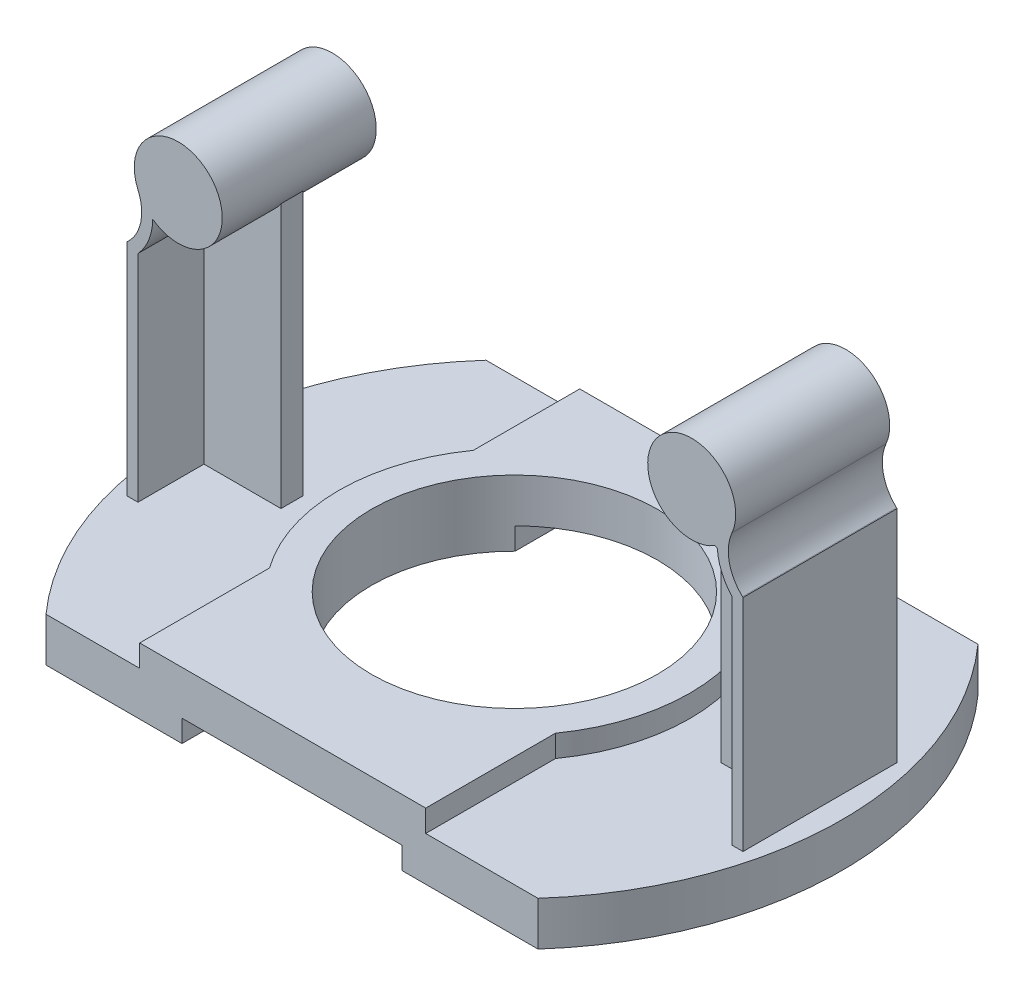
ISO-10303-21;
HEADER;
FILE_DESCRIPTION(('STEP AP214'),'2;1');
FILE_NAME('part.step','',(''),(''),'','','');
FILE_SCHEMA(('AUTOMOTIVE_DESIGN { 1 0 10303 214 1 1 1 1 }'));
ENDSEC;
DATA;
#1=APPLICATION_CONTEXT('core data for automotive mechanical design processes');
#2=APPLICATION_PROTOCOL_DEFINITION('international standard','automotive_design',2000,#1);
#3=PRODUCT_CONTEXT('',#1,'mechanical');
#4=PRODUCT('Part','Part','',(#3));
#5=PRODUCT_RELATED_PRODUCT_CATEGORY('part','',(#4));
#6=PRODUCT_DEFINITION_FORMATION('','',#4);
#7=PRODUCT_DEFINITION_CONTEXT('part definition',#1,'design');
#8=PRODUCT_DEFINITION('design','',#6,#7);
#9=PRODUCT_DEFINITION_SHAPE('','',#8);
#10=(LENGTH_UNIT() NAMED_UNIT(*) SI_UNIT(.MILLI.,.METRE.));
#11=(NAMED_UNIT(*) PLANE_ANGLE_UNIT() SI_UNIT($,.RADIAN.));
#12=(NAMED_UNIT(*) SI_UNIT($,.STERADIAN.) SOLID_ANGLE_UNIT());
#13=UNCERTAINTY_MEASURE_WITH_UNIT(LENGTH_MEASURE(1.E-05),#10,'distance_accuracy_value','');
#14=(GEOMETRIC_REPRESENTATION_CONTEXT(3) GLOBAL_UNCERTAINTY_ASSIGNED_CONTEXT((#13)) GLOBAL_UNIT_ASSIGNED_CONTEXT((#10,
#11,#12)) REPRESENTATION_CONTEXT('',''));
#15=CARTESIAN_POINT('',(0.,0.,0.));
#16=DIRECTION('',(0.,0.,1.));
#17=DIRECTION('',(1.,0.,0.));
#18=AXIS2_PLACEMENT_3D('',#15,#16,#17);
#19=CARTESIAN_POINT('',(-5.,-1.,-6.5));
#20=DIRECTION('',(-1.,0.,0.));
#21=DIRECTION('',(0.,0.,1.));
#22=AXIS2_PLACEMENT_3D('',#19,#20,#21);
#23=PLANE('',#22);
#24=DIRECTION('',(0.,0.,-1.));
#25=VECTOR('',#24,1.);
#26=CARTESIAN_POINT('',(-5.,-2.,3.5));
#27=LINE('',#26,#25);
#28=CARTESIAN_POINT('',(-5.,-2.,13.5));
#29=VERTEX_POINT('',#28);
#30=CARTESIAN_POINT('',(-5.,-2.,7.58416662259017));
#31=VERTEX_POINT('',#30);
#32=EDGE_CURVE('E339',#29,#31,#27,.T.);
#33=ORIENTED_EDGE('',*,*,#32,.T.);
#34=DIRECTION('',(0.,1.,0.));
#35=VECTOR('',#34,1.);
#36=CARTESIAN_POINT('',(-5.,-21.,7.58416662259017));
#37=LINE('',#36,#35);
#38=CARTESIAN_POINT('',(-5.,-1.,7.58416662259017));
#39=VERTEX_POINT('',#38);
#40=EDGE_CURVE('E347',#31,#39,#37,.T.);
#41=ORIENTED_EDGE('',*,*,#40,.T.);
#42=DIRECTION('',(0.,0.,1.));
#43=VECTOR('',#42,1.);
#44=CARTESIAN_POINT('',(-5.,-1.,-6.5));
#45=LINE('',#44,#43);
#46=CARTESIAN_POINT('',(-5.,-1.,13.5));
#47=VERTEX_POINT('',#46);
#48=EDGE_CURVE('E346',#39,#47,#45,.T.);
#49=ORIENTED_EDGE('',*,*,#48,.T.);
#50=DIRECTION('',(0.,-1.,0.));
#51=VECTOR('',#50,1.);
#52=CARTESIAN_POINT('',(-5.,-1.,13.5));
#53=LINE('',#52,#51);
#54=EDGE_CURVE('E695',#47,#29,#53,.T.);
#55=ORIENTED_EDGE('',*,*,#54,.T.);
#56=EDGE_LOOP('',(#33,#41,#49,#55));
#57=FACE_BOUND('',#56,.T.);
#58=ADVANCED_FACE('F35',(#57),#23,.F.);
#59=CARTESIAN_POINT('',(-5.,-1.,-6.5));
#60=DIRECTION('',(0.,1.,0.));
#61=DIRECTION('',(0.,0.,1.));
#62=AXIS2_PLACEMENT_3D('',#59,#60,#61);
#63=PLANE('',#62);
#64=DIRECTION('',(0.,0.,1.));
#65=VECTOR('',#64,1.);
#66=CARTESIAN_POINT('',(5.,-1.,-6.5));
#67=LINE('',#66,#65);
#68=CARTESIAN_POINT('',(5.,-1.,-6.5));
#69=VERTEX_POINT('',#68);
#70=CARTESIAN_POINT('',(5.,-1.,-0.6153029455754));
#71=VERTEX_POINT('',#70);
#72=EDGE_CURVE('E354',#69,#71,#67,.T.);
#73=ORIENTED_EDGE('',*,*,#72,.T.);
#74=CARTESIAN_POINT('',(-0.421622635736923,-1.,2.97022463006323));
#75=DIRECTION('',(0.,1.,0.));
#76=DIRECTION('',(0.,0.,1.));
#77=AXIS2_PLACEMENT_3D('',#74,#75,#76);
#78=CIRCLE('',#77,6.5);
#79=CARTESIAN_POINT('',(-5.,-1.,-1.64371736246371));
#80=VERTEX_POINT('',#79);
#81=EDGE_CURVE('E349',#71,#80,#78,.T.);
#82=ORIENTED_EDGE('',*,*,#81,.T.);
#83=CARTESIAN_POINT('',(-5.,-1.,-6.5));
#84=VERTEX_POINT('',#83);
#85=EDGE_CURVE('E363',#84,#80,#45,.T.);
#86=ORIENTED_EDGE('',*,*,#85,.F.);
#87=DIRECTION('',(-1.,0.,0.));
#88=VECTOR('',#87,1.);
#89=CARTESIAN_POINT('',(-5.,-1.,-6.5));
#90=LINE('',#89,#88);
#91=EDGE_CURVE('E355',#69,#84,#90,.T.);
#92=ORIENTED_EDGE('',*,*,#91,.F.);
#93=EDGE_LOOP('',(#73,#82,#86,#92));
#94=FACE_BOUND('',#93,.T.);
#95=ADVANCED_FACE('F765',(#94),#63,.F.);
#96=CARTESIAN_POINT('',(5.,-1.,-6.5));
#97=DIRECTION('',(1.,0.,0.));
#98=DIRECTION('',(0.,0.,-1.));
#99=AXIS2_PLACEMENT_3D('',#96,#97,#98);
#100=PLANE('',#99);
#101=DIRECTION('',(0.,0.,1.));
#102=VECTOR('',#101,1.);
#103=CARTESIAN_POINT('',(5.,-2.,3.5));
#104=LINE('',#103,#102);
#105=CARTESIAN_POINT('',(5.,-2.,-6.5));
#106=VERTEX_POINT('',#105);
#107=CARTESIAN_POINT('',(5.,-2.,-0.6153029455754));
#108=VERTEX_POINT('',#107);
#109=EDGE_CURVE('E614',#106,#108,#104,.T.);
#110=ORIENTED_EDGE('',*,*,#109,.T.);
#111=DIRECTION('',(0.,1.,0.));
#112=VECTOR('',#111,1.);
#113=CARTESIAN_POINT('',(5.,-21.,-0.6153029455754));
#114=LINE('',#113,#112);
#115=EDGE_CURVE('E11',#108,#71,#114,.T.);
#116=ORIENTED_EDGE('',*,*,#115,.T.);
#117=ORIENTED_EDGE('',*,*,#72,.F.);
#118=DIRECTION('',(0.,1.,0.));
#119=VECTOR('',#118,1.);
#120=CARTESIAN_POINT('',(5.,-1.,-6.5));
#121=LINE('',#120,#119);
#122=EDGE_CURVE('E359',#106,#69,#121,.T.);
#123=ORIENTED_EDGE('',*,*,#122,.F.);
#124=EDGE_LOOP('',(#110,#116,#117,#123));
#125=FACE_BOUND('',#124,.T.);
#126=ADVANCED_FACE('F763',(#125),#100,.F.);
#127=CARTESIAN_POINT('',(0.,0.,3.5));
#128=DIRECTION('',(0.,-1.,0.));
#129=DIRECTION('',(0.,0.,-1.));
#130=AXIS2_PLACEMENT_3D('',#127,#128,#129);
#131=PLANE('',#130);
#132=DIRECTION('',(1.,0.,0.));
#133=VECTOR('',#132,1.);
#134=CARTESIAN_POINT('',(-14.,0.,7.));
#135=LINE('',#134,#133);
#136=CARTESIAN_POINT('',(-14.,0.,7.));
#137=VERTEX_POINT('',#136);
#138=CARTESIAN_POINT('',(-13.5,0.,7.));
#139=VERTEX_POINT('',#138);
#140=EDGE_CURVE('E576',#137,#139,#135,.T.);
#141=ORIENTED_EDGE('',*,*,#140,.F.);
#142=DIRECTION('',(0.,0.,-1.));
#143=VECTOR('',#142,1.);
#144=CARTESIAN_POINT('',(-14.,0.,7.));
#145=LINE('',#144,#143);
#146=CARTESIAN_POINT('',(-14.,0.,0.));
#147=VERTEX_POINT('',#146);
#148=EDGE_CURVE('E602',#137,#147,#145,.T.);
#149=ORIENTED_EDGE('',*,*,#148,.T.);
#150=DIRECTION('',(1.,0.,0.));
#151=VECTOR('',#150,1.);
#152=CARTESIAN_POINT('',(-14.,0.,0.));
#153=LINE('',#152,#151);
#154=CARTESIAN_POINT('',(-13.5,0.,0.));
#155=VERTEX_POINT('',#154);
#156=EDGE_CURVE('E588',#147,#155,#153,.T.);
#157=ORIENTED_EDGE('',*,*,#156,.T.);
#158=DIRECTION('',(0.,0.,-1.));
#159=VECTOR('',#158,1.);
#160=CARTESIAN_POINT('',(-13.5,0.,3.));
#161=LINE('',#160,#159);
#162=CARTESIAN_POINT('',(-13.5,0.,3.));
#163=VERTEX_POINT('',#162);
#164=EDGE_CURVE('E541',#163,#155,#161,.T.);
#165=ORIENTED_EDGE('',*,*,#164,.F.);
#166=DIRECTION('',(-1.,0.,0.));
#167=VECTOR('',#166,1.);
#168=CARTESIAN_POINT('',(-10.,0.,3.));
#169=LINE('',#168,#167);
#170=CARTESIAN_POINT('',(-10.,0.,3.));
#171=VERTEX_POINT('',#170);
#172=EDGE_CURVE('E527',#171,#163,#169,.T.);
#173=ORIENTED_EDGE('',*,*,#172,.F.);
#174=DIRECTION('',(0.,0.,-1.));
#175=VECTOR('',#174,1.);
#176=CARTESIAN_POINT('',(-10.,0.,7.));
#177=LINE('',#176,#175);
#178=CARTESIAN_POINT('',(-10.,0.,4.));
#179=VERTEX_POINT('',#178);
#180=EDGE_CURVE('E599',#179,#171,#177,.T.);
#181=ORIENTED_EDGE('',*,*,#180,.F.);
#182=DIRECTION('',(1.,0.,0.));
#183=VECTOR('',#182,1.);
#184=CARTESIAN_POINT('',(-10.,0.,4.));
#185=LINE('',#184,#183);
#186=CARTESIAN_POINT('',(-13.5,0.,4.));
#187=VERTEX_POINT('',#186);
#188=EDGE_CURVE('E553',#187,#179,#185,.T.);
#189=ORIENTED_EDGE('',*,*,#188,.F.);
#190=DIRECTION('',(0.,0.,1.));
#191=VECTOR('',#190,1.);
#192=CARTESIAN_POINT('',(-13.5,0.,4.));
#193=LINE('',#192,#191);
#194=EDGE_CURVE('E569',#187,#139,#193,.T.);
#195=ORIENTED_EDGE('',*,*,#194,.T.);
#196=EDGE_LOOP('',(#141,#149,#157,#165,#173,#181,#189,#195));
#197=FACE_BOUND('',#196,.T.);
#198=DIRECTION('',(0.,0.,1.));
#199=VECTOR('',#198,1.);
#200=CARTESIAN_POINT('',(-6.92162263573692,0.,-6.5));
#201=LINE('',#200,#199);
#202=CARTESIAN_POINT('',(-6.92162263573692,0.,-6.5));
#203=VERTEX_POINT('',#202);
#204=CARTESIAN_POINT('',(-6.92162263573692,0.,-1.66139186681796));
#205=VERTEX_POINT('',#204);
#206=EDGE_CURVE('E654',#203,#205,#201,.T.);
#207=ORIENTED_EDGE('',*,*,#206,.F.);
#208=DIRECTION('',(1.,0.,0.));
#209=VECTOR('',#208,1.);
#210=CARTESIAN_POINT('',(-11.1803398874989,0.,-6.5));
#211=LINE('',#210,#209);
#212=CARTESIAN_POINT('',(-11.1803398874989,0.,-6.5));
#213=VERTEX_POINT('',#212);
#214=EDGE_CURVE('E484',#213,#203,#211,.T.);
#215=ORIENTED_EDGE('',*,*,#214,.F.);
#216=CARTESIAN_POINT('',(0.,0.,3.5));
#217=DIRECTION('',(0.,-1.,0.));
#218=DIRECTION('',(0.,0.,-1.));
#219=AXIS2_PLACEMENT_3D('',#216,#217,#218);
#220=CIRCLE('',#219,15.);
#221=CARTESIAN_POINT('',(-11.1803398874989,0.,13.5));
#222=VERTEX_POINT('',#221);
#223=EDGE_CURVE('E501',#222,#213,#220,.T.);
#224=ORIENTED_EDGE('',*,*,#223,.F.);
#225=DIRECTION('',(-1.,0.,0.));
#226=VECTOR('',#225,1.);
#227=CARTESIAN_POINT('',(-11.1803398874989,0.,13.5));
#228=LINE('',#227,#226);
#229=CARTESIAN_POINT('',(-6.92162263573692,0.,13.5));
#230=VERTEX_POINT('',#229);
#231=EDGE_CURVE('E497',#230,#222,#228,.T.);
#232=ORIENTED_EDGE('',*,*,#231,.F.);
#233=DIRECTION('',(0.,0.,1.));
#234=VECTOR('',#233,1.);
#235=CARTESIAN_POINT('',(-6.92162263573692,0.,7.60184112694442));
#236=LINE('',#235,#234);
#237=CARTESIAN_POINT('',(-6.92162263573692,0.,7.60184112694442));
#238=VERTEX_POINT('',#237);
#239=EDGE_CURVE('E661',#238,#230,#236,.T.);
#240=ORIENTED_EDGE('',*,*,#239,.F.);
#241=CARTESIAN_POINT('',(-0.421622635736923,0.,2.97022463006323));
#242=DIRECTION('',(0.,1.,0.));
#243=DIRECTION('',(0.,0.,1.));
#244=AXIS2_PLACEMENT_3D('',#241,#242,#243);
#245=CIRCLE('',#244,7.9813452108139);
#246=EDGE_CURVE('E656',#205,#238,#245,.T.);
#247=ORIENTED_EDGE('',*,*,#246,.F.);
#248=EDGE_LOOP('',(#207,#215,#224,#232,#240,#247));
#249=FACE_BOUND('',#248,.T.);
#250=ADVANCED_FACE('F650',(#197,#249),#131,.F.);
#251=DIRECTION('',(1.,0.,0.));
#252=VECTOR('',#251,1.);
#253=CARTESIAN_POINT('',(14.,0.,7.));
#254=LINE('',#253,#252);
#255=CARTESIAN_POINT('',(13.5,0.,7.));
#256=VERTEX_POINT('',#255);
#257=CARTESIAN_POINT('',(14.,0.,7.));
#258=VERTEX_POINT('',#257);
#259=EDGE_CURVE('E442',#256,#258,#254,.T.);
#260=ORIENTED_EDGE('',*,*,#259,.F.);
#261=DIRECTION('',(0.,0.,1.));
#262=VECTOR('',#261,1.);
#263=CARTESIAN_POINT('',(13.5,0.,4.));
#264=LINE('',#263,#262);
#265=CARTESIAN_POINT('',(13.5,0.,4.));
#266=VERTEX_POINT('',#265);
#267=EDGE_CURVE('E421',#266,#256,#264,.T.);
#268=ORIENTED_EDGE('',*,*,#267,.F.);
#269=DIRECTION('',(1.,0.,0.));
#270=VECTOR('',#269,1.);
#271=CARTESIAN_POINT('',(13.5,0.,4.));
#272=LINE('',#271,#270);
#273=CARTESIAN_POINT('',(10.,0.,4.));
#274=VERTEX_POINT('',#273);
#275=EDGE_CURVE('E409',#274,#266,#272,.T.);
#276=ORIENTED_EDGE('',*,*,#275,.F.);
#277=DIRECTION('',(0.,0.,-1.));
#278=VECTOR('',#277,1.);
#279=CARTESIAN_POINT('',(10.,0.,7.));
#280=LINE('',#279,#278);
#281=CARTESIAN_POINT('',(10.,0.,3.));
#282=VERTEX_POINT('',#281);
#283=EDGE_CURVE('E464',#274,#282,#280,.T.);
#284=ORIENTED_EDGE('',*,*,#283,.T.);
#285=DIRECTION('',(-1.,0.,0.));
#286=VECTOR('',#285,1.);
#287=CARTESIAN_POINT('',(13.5,0.,3.));
#288=LINE('',#287,#286);
#289=CARTESIAN_POINT('',(13.5,0.,3.));
#290=VERTEX_POINT('',#289);
#291=EDGE_CURVE('E374',#290,#282,#288,.T.);
#292=ORIENTED_EDGE('',*,*,#291,.F.);
#293=DIRECTION('',(0.,0.,-1.));
#294=VECTOR('',#293,1.);
#295=CARTESIAN_POINT('',(13.5,0.,3.));
#296=LINE('',#295,#294);
#297=CARTESIAN_POINT('',(13.5,0.,0.));
#298=VERTEX_POINT('',#297);
#299=EDGE_CURVE('E396',#290,#298,#296,.T.);
#300=ORIENTED_EDGE('',*,*,#299,.T.);
#301=DIRECTION('',(1.,0.,0.));
#302=VECTOR('',#301,1.);
#303=CARTESIAN_POINT('',(14.,0.,0.));
#304=LINE('',#303,#302);
#305=CARTESIAN_POINT('',(14.,0.,0.));
#306=VERTEX_POINT('',#305);
#307=EDGE_CURVE('E453',#298,#306,#304,.T.);
#308=ORIENTED_EDGE('',*,*,#307,.T.);
#309=DIRECTION('',(0.,0.,-1.));
#310=VECTOR('',#309,1.);
#311=CARTESIAN_POINT('',(14.,0.,7.));
#312=LINE('',#311,#310);
#313=EDGE_CURVE('E462',#258,#306,#312,.T.);
#314=ORIENTED_EDGE('',*,*,#313,.F.);
#315=EDGE_LOOP('',(#260,#268,#276,#284,#292,#300,#308,#314));
#316=FACE_BOUND('',#315,.T.);
#317=DIRECTION('',(0.,0.,-1.));
#318=VECTOR('',#317,1.);
#319=CARTESIAN_POINT('',(6.07837736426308,0.,7.60184112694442));
#320=LINE('',#319,#318);
#321=CARTESIAN_POINT('',(6.07837736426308,0.,13.5));
#322=VERTEX_POINT('',#321);
#323=CARTESIAN_POINT('',(6.07837736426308,0.,7.60184112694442));
#324=VERTEX_POINT('',#323);
#325=EDGE_CURVE('E670',#322,#324,#320,.T.);
#326=ORIENTED_EDGE('',*,*,#325,.F.);
#327=CARTESIAN_POINT('',(11.1803398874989,0.,13.5));
#328=VERTEX_POINT('',#327);
#329=EDGE_CURVE('E498',#328,#322,#228,.T.);
#330=ORIENTED_EDGE('',*,*,#329,.F.);
#331=CARTESIAN_POINT('',(0.,0.,3.5));
#332=DIRECTION('',(0.,-1.,0.));
#333=DIRECTION('',(0.,0.,-1.));
#334=AXIS2_PLACEMENT_3D('',#331,#332,#333);
#335=CIRCLE('',#334,15.);
#336=CARTESIAN_POINT('',(11.1803398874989,0.,-6.5));
#337=VERTEX_POINT('',#336);
#338=EDGE_CURVE('E479',#337,#328,#335,.T.);
#339=ORIENTED_EDGE('',*,*,#338,.F.);
#340=CARTESIAN_POINT('',(6.07837736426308,0.,-6.5));
#341=VERTEX_POINT('',#340);
#342=EDGE_CURVE('E503',#341,#337,#211,.T.);
#343=ORIENTED_EDGE('',*,*,#342,.F.);
#344=DIRECTION('',(0.,0.,-1.));
#345=VECTOR('',#344,1.);
#346=CARTESIAN_POINT('',(6.07837736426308,0.,-6.5));
#347=LINE('',#346,#345);
#348=CARTESIAN_POINT('',(6.07837736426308,0.,-1.66139186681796));
#349=VERTEX_POINT('',#348);
#350=EDGE_CURVE('E674',#349,#341,#347,.T.);
#351=ORIENTED_EDGE('',*,*,#350,.F.);
#352=CARTESIAN_POINT('',(-0.421622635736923,0.,2.97022463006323));
#353=DIRECTION('',(0.,1.,0.));
#354=DIRECTION('',(0.,0.,1.));
#355=AXIS2_PLACEMENT_3D('',#352,#353,#354);
#356=CIRCLE('',#355,7.9813452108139);
#357=EDGE_CURVE('E672',#324,#349,#356,.T.);
#358=ORIENTED_EDGE('',*,*,#357,.F.);
#359=EDGE_LOOP('',(#326,#330,#339,#343,#351,#358));
#360=FACE_BOUND('',#359,.T.);
#361=ADVANCED_FACE('F752',(#316,#360),#131,.F.);
#362=CARTESIAN_POINT('',(0.,-2.,3.5));
#363=DIRECTION('',(0.,-1.,0.));
#364=DIRECTION('',(0.,0.,-1.));
#365=AXIS2_PLACEMENT_3D('',#362,#363,#364);
#366=PLANE('',#365);
#367=CARTESIAN_POINT('',(-0.421622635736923,-2.,2.97022463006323));
#368=DIRECTION('',(0.,-1.,0.));
#369=DIRECTION('',(0.,0.,-1.));
#370=AXIS2_PLACEMENT_3D('',#367,#368,#369);
#371=CIRCLE('',#370,6.5);
#372=CARTESIAN_POINT('',(-5.,-2.,-1.64371736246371));
#373=VERTEX_POINT('',#372);
#374=EDGE_CURVE('E702',#31,#373,#371,.T.);
#375=ORIENTED_EDGE('',*,*,#374,.F.);
#376=ORIENTED_EDGE('',*,*,#32,.F.);
#377=DIRECTION('',(-1.,0.,0.));
#378=VECTOR('',#377,1.);
#379=CARTESIAN_POINT('',(-11.1803398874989,-2.,13.5));
#380=LINE('',#379,#378);
#381=CARTESIAN_POINT('',(-11.1803398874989,-2.,13.5));
#382=VERTEX_POINT('',#381);
#383=EDGE_CURVE('E483',#29,#382,#380,.T.);
#384=ORIENTED_EDGE('',*,*,#383,.T.);
#385=CARTESIAN_POINT('',(0.,-2.,3.5));
#386=DIRECTION('',(0.,-1.,0.));
#387=DIRECTION('',(0.,0.,-1.));
#388=AXIS2_PLACEMENT_3D('',#385,#386,#387);
#389=CIRCLE('',#388,15.);
#390=CARTESIAN_POINT('',(-11.1803398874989,-2.,-6.5));
#391=VERTEX_POINT('',#390);
#392=EDGE_CURVE('E488',#382,#391,#389,.T.);
#393=ORIENTED_EDGE('',*,*,#392,.T.);
#394=DIRECTION('',(1.,0.,0.));
#395=VECTOR('',#394,1.);
#396=CARTESIAN_POINT('',(-11.1803398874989,-2.,-6.5));
#397=LINE('',#396,#395);
#398=CARTESIAN_POINT('',(-5.,-2.,-6.5));
#399=VERTEX_POINT('',#398);
#400=EDGE_CURVE('E491',#391,#399,#397,.T.);
#401=ORIENTED_EDGE('',*,*,#400,.T.);
#402=EDGE_CURVE('E617',#373,#399,#27,.T.);
#403=ORIENTED_EDGE('',*,*,#402,.F.);
#404=EDGE_LOOP('',(#375,#376,#384,#393,#401,#403));
#405=FACE_BOUND('',#404,.T.);
#406=ADVANCED_FACE('F638',(#405),#366,.T.);
#407=CARTESIAN_POINT('',(-10.,0.,7.));
#408=DIRECTION('',(-1.,0.,0.));
#409=DIRECTION('',(0.,0.,1.));
#410=AXIS2_PLACEMENT_3D('',#407,#408,#409);
#411=PLANE('',#410);
#412=DIRECTION('',(0.,-1.,0.));
#413=VECTOR('',#412,1.);
#414=CARTESIAN_POINT('',(-10.,12.,3.));
#415=LINE('',#414,#413);
#416=CARTESIAN_POINT('',(-10.,12.,3.));
#417=VERTEX_POINT('',#416);
#418=EDGE_CURVE('E524',#417,#171,#415,.T.);
#419=ORIENTED_EDGE('',*,*,#418,.F.);
#420=DIRECTION('',(0.,0.,-1.));
#421=VECTOR('',#420,1.);
#422=CARTESIAN_POINT('',(-10.,12.,7.));
#423=LINE('',#422,#421);
#424=CARTESIAN_POINT('',(-10.,12.,4.));
#425=VERTEX_POINT('',#424);
#426=EDGE_CURVE('E596',#425,#417,#423,.T.);
#427=ORIENTED_EDGE('',*,*,#426,.F.);
#428=DIRECTION('',(0.,1.,0.));
#429=VECTOR('',#428,1.);
#430=CARTESIAN_POINT('',(-10.,12.,4.));
#431=LINE('',#430,#429);
#432=EDGE_CURVE('E556',#179,#425,#431,.T.);
#433=ORIENTED_EDGE('',*,*,#432,.F.);
#434=ORIENTED_EDGE('',*,*,#180,.T.);
#435=EDGE_LOOP('',(#419,#427,#433,#434));
#436=FACE_BOUND('',#435,.T.);
#437=ADVANCED_FACE('F905',(#436),#411,.F.);
#438=CARTESIAN_POINT('',(-14.,0.,7.));
#439=DIRECTION('',(1.,0.,0.));
#440=DIRECTION('',(0.,1.,0.));
#441=AXIS2_PLACEMENT_3D('',#438,#439,#440);
#442=PLANE('',#441);
#443=DIRECTION('',(0.,-1.,0.));
#444=VECTOR('',#443,1.);
#445=CARTESIAN_POINT('',(-14.,0.,0.));
#446=LINE('',#445,#444);
#447=CARTESIAN_POINT('',(-14.,10.,0.));
#448=VERTEX_POINT('',#447);
#449=EDGE_CURVE('E568',#448,#147,#446,.T.);
#450=ORIENTED_EDGE('',*,*,#449,.T.);
#451=ORIENTED_EDGE('',*,*,#148,.F.);
#452=DIRECTION('',(0.,-1.,0.));
#453=VECTOR('',#452,1.);
#454=CARTESIAN_POINT('',(-14.,0.,7.));
#455=LINE('',#454,#453);
#456=CARTESIAN_POINT('',(-14.,10.,7.));
#457=VERTEX_POINT('',#456);
#458=EDGE_CURVE('E573',#457,#137,#455,.T.);
#459=ORIENTED_EDGE('',*,*,#458,.F.);
#460=DIRECTION('',(0.,0.,-1.));
#461=VECTOR('',#460,1.);
#462=CARTESIAN_POINT('',(-14.,10.,7.));
#463=LINE('',#462,#461);
#464=EDGE_CURVE('E585',#457,#448,#463,.T.);
#465=ORIENTED_EDGE('',*,*,#464,.T.);
#466=EDGE_LOOP('',(#450,#451,#459,#465));
#467=FACE_BOUND('',#466,.T.);
#468=ADVANCED_FACE('F903',(#467),#442,.F.);
#469=CARTESIAN_POINT('',(-11.6686608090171,13.1025294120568,7.));
#470=DIRECTION('',(0.,0.,-1.));
#471=DIRECTION('',(-1.,0.,0.));
#472=AXIS2_PLACEMENT_3D('',#469,#470,#471);
#473=CYLINDRICAL_SURFACE('',#472,2.);
#474=CARTESIAN_POINT('',(-11.6686608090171,13.1025294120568,0.));
#475=DIRECTION('',(0.,0.,1.));
#476=DIRECTION('',(1.,0.,0.));
#477=AXIS2_PLACEMENT_3D('',#474,#475,#476);
#478=CIRCLE('',#477,2.);
#479=CARTESIAN_POINT('',(-12.8307831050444,11.4748096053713,0.));
#480=VERTEX_POINT('',#479);
#481=CARTESIAN_POINT('',(-13.4996874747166,12.2979541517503,0.));
#482=VERTEX_POINT('',#481);
#483=EDGE_CURVE('E590',#480,#482,#478,.T.);
#484=ORIENTED_EDGE('',*,*,#483,.T.);
#485=DIRECTION('',(0.,0.,-1.));
#486=VECTOR('',#485,1.);
#487=CARTESIAN_POINT('',(-13.4996874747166,12.2979541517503,7.));
#488=LINE('',#487,#486);
#489=CARTESIAN_POINT('',(-13.4996874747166,12.2979541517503,7.));
#490=VERTEX_POINT('',#489);
#491=EDGE_CURVE('E607',#482,#490,#488,.F.);
#492=ORIENTED_EDGE('',*,*,#491,.T.);
#493=CARTESIAN_POINT('',(-11.6686608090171,13.1025294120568,7.));
#494=DIRECTION('',(0.,0.,1.));
#495=DIRECTION('',(1.,0.,0.));
#496=AXIS2_PLACEMENT_3D('',#493,#494,#495);
#497=CIRCLE('',#496,2.);
#498=CARTESIAN_POINT('',(-12.8307831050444,11.4748096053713,7.));
#499=VERTEX_POINT('',#498);
#500=EDGE_CURVE('E580',#499,#490,#497,.T.);
#501=ORIENTED_EDGE('',*,*,#500,.F.);
#502=DIRECTION('',(0.,0.,1.));
#503=VECTOR('',#502,1.);
#504=CARTESIAN_POINT('',(-12.8307831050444,11.4748096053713,4.));
#505=LINE('',#504,#503);
#506=CARTESIAN_POINT('',(-12.8307831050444,11.4748096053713,4.));
#507=VERTEX_POINT('',#506);
#508=EDGE_CURVE('E565',#507,#499,#505,.T.);
#509=ORIENTED_EDGE('',*,*,#508,.F.);
#510=CARTESIAN_POINT('',(-11.6686608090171,13.1025294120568,4.));
#511=DIRECTION('',(0.,0.,-1.));
#512=DIRECTION('',(1.,0.,0.));
#513=AXIS2_PLACEMENT_3D('',#510,#511,#512);
#514=CIRCLE('',#513,2.);
#515=EDGE_CURVE('E558',#425,#507,#514,.T.);
#516=ORIENTED_EDGE('',*,*,#515,.F.);
#517=ORIENTED_EDGE('',*,*,#426,.T.);
#518=CARTESIAN_POINT('',(-11.6686608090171,13.1025294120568,3.));
#519=DIRECTION('',(0.,0.,1.));
#520=DIRECTION('',(-1.,0.,0.));
#521=AXIS2_PLACEMENT_3D('',#518,#519,#520);
#522=CIRCLE('',#521,2.);
#523=CARTESIAN_POINT('',(-12.8307831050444,11.4748096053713,3.));
#524=VERTEX_POINT('',#523);
#525=EDGE_CURVE('E521',#524,#417,#522,.T.);
#526=ORIENTED_EDGE('',*,*,#525,.F.);
#527=DIRECTION('',(0.,0.,-1.));
#528=VECTOR('',#527,1.);
#529=CARTESIAN_POINT('',(-12.8307831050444,11.4748096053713,3.));
#530=LINE('',#529,#528);
#531=EDGE_CURVE('E533',#524,#480,#530,.T.);
#532=ORIENTED_EDGE('',*,*,#531,.T.);
#533=EDGE_LOOP('',(#484,#492,#501,#509,#516,#517,#526,#532));
#534=FACE_BOUND('',#533,.T.);
#535=ADVANCED_FACE('F899',(#534),#473,.T.);
#536=CARTESIAN_POINT('',(-14.,10.,7.));
#537=DIRECTION('',(0.676882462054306,-0.736091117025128,0.));
#538=DIRECTION('',(0.736091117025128,0.676882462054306,0.));
#539=AXIS2_PLACEMENT_3D('',#536,#537,#538);
#540=PLANE('',#539);
#541=DIRECTION('',(-0.736091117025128,-0.676882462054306,0.));
#542=VECTOR('',#541,1.);
#543=CARTESIAN_POINT('',(-14.,10.,7.));
#544=LINE('',#543,#542);
#545=CARTESIAN_POINT('',(-13.9769492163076,10.0211966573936,7.));
#546=VERTEX_POINT('',#545);
#547=EDGE_CURVE('E583',#546,#457,#544,.T.);
#548=ORIENTED_EDGE('',*,*,#547,.F.);
#549=DIRECTION('',(0.,0.,1.));
#550=VECTOR('',#549,1.);
#551=CARTESIAN_POINT('',(-13.9769492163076,10.0211966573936,0.));
#552=LINE('',#551,#550);
#553=CARTESIAN_POINT('',(-13.9769492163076,10.0211966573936,0.));
#554=VERTEX_POINT('',#553);
#555=EDGE_CURVE('E604',#546,#554,#552,.F.);
#556=ORIENTED_EDGE('',*,*,#555,.T.);
#557=DIRECTION('',(-0.736091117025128,-0.676882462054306,0.));
#558=VECTOR('',#557,1.);
#559=CARTESIAN_POINT('',(-14.,10.,0.));
#560=LINE('',#559,#558);
#561=EDGE_CURVE('E577',#554,#448,#560,.T.);
#562=ORIENTED_EDGE('',*,*,#561,.T.);
#563=ORIENTED_EDGE('',*,*,#464,.F.);
#564=EDGE_LOOP('',(#548,#556,#562,#563));
#565=FACE_BOUND('',#564,.T.);
#566=ADVANCED_FACE('F892',(#565),#540,.F.);
#567=CARTESIAN_POINT('',(-11.6686608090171,13.1025294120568,7.));
#568=DIRECTION('',(0.,0.,1.));
#569=DIRECTION('',(1.,0.,0.));
#570=AXIS2_PLACEMENT_3D('',#567,#568,#569);
#571=PLANE('',#570);
#572=CARTESIAN_POINT('',(-15.3307141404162,11.4933788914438,7.));
#573=DIRECTION('',(0.,0.,-1.));
#574=DIRECTION('',(1.,0.,0.));
#575=AXIS2_PLACEMENT_3D('',#572,#573,#574);
#576=CIRCLE('',#575,2.5);
#577=CARTESIAN_POINT('',(-13.5,9.7908849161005,7.));
#578=VERTEX_POINT('',#577);
#579=EDGE_CURVE('E540',#499,#578,#576,.T.);
#580=ORIENTED_EDGE('',*,*,#579,.F.);
#581=ORIENTED_EDGE('',*,*,#500,.T.);
#582=CARTESIAN_POINT('',(-15.3307141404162,11.4933788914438,7.));
#583=DIRECTION('',(0.,0.,1.));
#584=DIRECTION('',(1.,0.,0.));
#585=AXIS2_PLACEMENT_3D('',#582,#583,#584);
#586=CIRCLE('',#585,2.);
#587=EDGE_CURVE('E611',#490,#546,#586,.F.);
#588=ORIENTED_EDGE('',*,*,#587,.T.);
#589=ORIENTED_EDGE('',*,*,#547,.T.);
#590=ORIENTED_EDGE('',*,*,#458,.T.);
#591=ORIENTED_EDGE('',*,*,#140,.T.);
#592=DIRECTION('',(0.,-1.,0.));
#593=VECTOR('',#592,1.);
#594=CARTESIAN_POINT('',(-13.5,9.7908849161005,7.));
#595=LINE('',#594,#593);
#596=EDGE_CURVE('E550',#578,#139,#595,.T.);
#597=ORIENTED_EDGE('',*,*,#596,.F.);
#598=EDGE_LOOP('',(#580,#581,#588,#589,#590,#591,#597));
#599=FACE_BOUND('',#598,.T.);
#600=ADVANCED_FACE('F888',(#599),#571,.T.);
#601=CARTESIAN_POINT('',(-11.6686608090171,13.1025294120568,0.));
#602=DIRECTION('',(0.,0.,1.));
#603=DIRECTION('',(1.,0.,0.));
#604=AXIS2_PLACEMENT_3D('',#601,#602,#603);
#605=PLANE('',#604);
#606=CARTESIAN_POINT('',(-15.3307141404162,11.4933788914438,0.));
#607=DIRECTION('',(0.,0.,1.));
#608=DIRECTION('',(-1.,0.,0.));
#609=AXIS2_PLACEMENT_3D('',#606,#607,#608);
#610=CIRCLE('',#609,2.5);
#611=CARTESIAN_POINT('',(-13.5,9.7908849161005,0.));
#612=VERTEX_POINT('',#611);
#613=EDGE_CURVE('E517',#612,#480,#610,.T.);
#614=ORIENTED_EDGE('',*,*,#613,.F.);
#615=DIRECTION('',(0.,1.,0.));
#616=VECTOR('',#615,1.);
#617=CARTESIAN_POINT('',(-13.5,0.,0.));
#618=LINE('',#617,#616);
#619=EDGE_CURVE('E522',#155,#612,#618,.T.);
#620=ORIENTED_EDGE('',*,*,#619,.F.);
#621=ORIENTED_EDGE('',*,*,#156,.F.);
#622=ORIENTED_EDGE('',*,*,#449,.F.);
#623=ORIENTED_EDGE('',*,*,#561,.F.);
#624=CARTESIAN_POINT('',(-15.3307141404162,11.4933788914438,0.));
#625=DIRECTION('',(0.,0.,1.));
#626=DIRECTION('',(1.,0.,0.));
#627=AXIS2_PLACEMENT_3D('',#624,#625,#626);
#628=CIRCLE('',#627,2.);
#629=EDGE_CURVE('E609',#554,#482,#628,.T.);
#630=ORIENTED_EDGE('',*,*,#629,.T.);
#631=ORIENTED_EDGE('',*,*,#483,.F.);
#632=EDGE_LOOP('',(#614,#620,#621,#622,#623,#630,#631));
#633=FACE_BOUND('',#632,.T.);
#634=ADVANCED_FACE('F891',(#633),#605,.F.);
#635=CARTESIAN_POINT('',(-15.3307141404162,11.4933788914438,7.));
#636=DIRECTION('',(0.,0.,-1.));
#637=DIRECTION('',(-1.,0.,0.));
#638=AXIS2_PLACEMENT_3D('',#635,#636,#637);
#639=CYLINDRICAL_SURFACE('',#638,2.);
#640=ORIENTED_EDGE('',*,*,#587,.F.);
#641=ORIENTED_EDGE('',*,*,#491,.F.);
#642=ORIENTED_EDGE('',*,*,#629,.F.);
#643=ORIENTED_EDGE('',*,*,#555,.F.);
#644=EDGE_LOOP('',(#640,#641,#642,#643));
#645=FACE_BOUND('',#644,.T.);
#646=ADVANCED_FACE('F37',(#645),#639,.F.);
#647=CARTESIAN_POINT('',(-15.3307141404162,11.4933788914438,4.));
#648=DIRECTION('',(0.,0.,1.));
#649=DIRECTION('',(1.,0.,0.));
#650=AXIS2_PLACEMENT_3D('',#647,#648,#649);
#651=CYLINDRICAL_SURFACE('',#650,2.5);
#652=ORIENTED_EDGE('',*,*,#579,.T.);
#653=DIRECTION('',(0.,0.,1.));
#654=VECTOR('',#653,1.);
#655=CARTESIAN_POINT('',(-13.5,9.7908849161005,4.));
#656=LINE('',#655,#654);
#657=CARTESIAN_POINT('',(-13.5,9.7908849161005,4.));
#658=VERTEX_POINT('',#657);
#659=EDGE_CURVE('E561',#658,#578,#656,.T.);
#660=ORIENTED_EDGE('',*,*,#659,.F.);
#661=CARTESIAN_POINT('',(-15.3307141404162,11.4933788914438,4.));
#662=DIRECTION('',(0.,0.,-1.));
#663=DIRECTION('',(1.,0.,0.));
#664=AXIS2_PLACEMENT_3D('',#661,#662,#663);
#665=CIRCLE('',#664,2.5);
#666=EDGE_CURVE('E546',#507,#658,#665,.T.);
#667=ORIENTED_EDGE('',*,*,#666,.F.);
#668=ORIENTED_EDGE('',*,*,#508,.T.);
#669=EDGE_LOOP('',(#652,#660,#667,#668));
#670=FACE_BOUND('',#669,.T.);
#671=ADVANCED_FACE('F883',(#670),#651,.T.);
#672=CARTESIAN_POINT('',(-13.5,9.7908849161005,4.));
#673=DIRECTION('',(-1.,0.,0.));
#674=DIRECTION('',(0.,-1.,0.));
#675=AXIS2_PLACEMENT_3D('',#672,#673,#674);
#676=PLANE('',#675);
#677=ORIENTED_EDGE('',*,*,#596,.T.);
#678=ORIENTED_EDGE('',*,*,#194,.F.);
#679=DIRECTION('',(0.,-1.,0.));
#680=VECTOR('',#679,1.);
#681=CARTESIAN_POINT('',(-13.5,9.7908849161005,4.));
#682=LINE('',#681,#680);
#683=EDGE_CURVE('E549',#658,#187,#682,.T.);
#684=ORIENTED_EDGE('',*,*,#683,.F.);
#685=ORIENTED_EDGE('',*,*,#659,.T.);
#686=EDGE_LOOP('',(#677,#678,#684,#685));
#687=FACE_BOUND('',#686,.T.);
#688=ADVANCED_FACE('F879',(#687),#676,.F.);
#689=CARTESIAN_POINT('',(-15.3307141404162,11.4933788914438,4.));
#690=DIRECTION('',(0.,0.,1.));
#691=DIRECTION('',(1.,0.,0.));
#692=AXIS2_PLACEMENT_3D('',#689,#690,#691);
#693=PLANE('',#692);
#694=ORIENTED_EDGE('',*,*,#666,.T.);
#695=ORIENTED_EDGE('',*,*,#683,.T.);
#696=ORIENTED_EDGE('',*,*,#188,.T.);
#697=ORIENTED_EDGE('',*,*,#432,.T.);
#698=ORIENTED_EDGE('',*,*,#515,.T.);
#699=EDGE_LOOP('',(#694,#695,#696,#697,#698));
#700=FACE_BOUND('',#699,.T.);
#701=ADVANCED_FACE('F875',(#700),#693,.T.);
#702=CARTESIAN_POINT('',(-15.3307141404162,11.4933788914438,3.));
#703=DIRECTION('',(0.,0.,-1.));
#704=DIRECTION('',(-1.,0.,0.));
#705=AXIS2_PLACEMENT_3D('',#702,#703,#704);
#706=CYLINDRICAL_SURFACE('',#705,2.5);
#707=ORIENTED_EDGE('',*,*,#613,.T.);
#708=ORIENTED_EDGE('',*,*,#531,.F.);
#709=CARTESIAN_POINT('',(-15.3307141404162,11.4933788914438,3.));
#710=DIRECTION('',(0.,0.,1.));
#711=DIRECTION('',(-1.,0.,0.));
#712=AXIS2_PLACEMENT_3D('',#709,#710,#711);
#713=CIRCLE('',#712,2.5);
#714=CARTESIAN_POINT('',(-13.5,9.7908849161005,3.));
#715=VERTEX_POINT('',#714);
#716=EDGE_CURVE('E518',#715,#524,#713,.T.);
#717=ORIENTED_EDGE('',*,*,#716,.F.);
#718=DIRECTION('',(0.,0.,-1.));
#719=VECTOR('',#718,1.);
#720=CARTESIAN_POINT('',(-13.5,9.7908849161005,3.));
#721=LINE('',#720,#719);
#722=EDGE_CURVE('E538',#715,#612,#721,.T.);
#723=ORIENTED_EDGE('',*,*,#722,.T.);
#724=EDGE_LOOP('',(#707,#708,#717,#723));
#725=FACE_BOUND('',#724,.T.);
#726=ADVANCED_FACE('F871',(#725),#706,.T.);
#727=CARTESIAN_POINT('',(-13.5,0.,3.));
#728=DIRECTION('',(-1.,0.,0.));
#729=DIRECTION('',(0.,-1.,0.));
#730=AXIS2_PLACEMENT_3D('',#727,#728,#729);
#731=PLANE('',#730);
#732=ORIENTED_EDGE('',*,*,#619,.T.);
#733=ORIENTED_EDGE('',*,*,#722,.F.);
#734=DIRECTION('',(0.,1.,0.));
#735=VECTOR('',#734,1.);
#736=CARTESIAN_POINT('',(-13.5,0.,3.));
#737=LINE('',#736,#735);
#738=EDGE_CURVE('E530',#163,#715,#737,.T.);
#739=ORIENTED_EDGE('',*,*,#738,.F.);
#740=ORIENTED_EDGE('',*,*,#164,.T.);
#741=EDGE_LOOP('',(#732,#733,#739,#740));
#742=FACE_BOUND('',#741,.T.);
#743=ADVANCED_FACE('F867',(#742),#731,.F.);
#744=CARTESIAN_POINT('',(-15.3307141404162,11.4933788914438,3.));
#745=DIRECTION('',(0.,0.,-1.));
#746=DIRECTION('',(-1.,0.,0.));
#747=AXIS2_PLACEMENT_3D('',#744,#745,#746);
#748=PLANE('',#747);
#749=ORIENTED_EDGE('',*,*,#716,.T.);
#750=ORIENTED_EDGE('',*,*,#525,.T.);
#751=ORIENTED_EDGE('',*,*,#418,.T.);
#752=ORIENTED_EDGE('',*,*,#172,.T.);
#753=ORIENTED_EDGE('',*,*,#738,.T.);
#754=EDGE_LOOP('',(#749,#750,#751,#752,#753));
#755=FACE_BOUND('',#754,.T.);
#756=ADVANCED_FACE('F864',(#755),#748,.T.);
#757=CARTESIAN_POINT('',(0.,-2.,3.5));
#758=DIRECTION('',(0.,1.,0.));
#759=DIRECTION('',(0.,0.,1.));
#760=AXIS2_PLACEMENT_3D('',#757,#758,#759);
#761=CYLINDRICAL_SURFACE('',#760,15.);
#762=ORIENTED_EDGE('',*,*,#338,.T.);
#763=DIRECTION('',(0.,1.,0.));
#764=VECTOR('',#763,1.);
#765=CARTESIAN_POINT('',(11.1803398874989,-2.,13.5));
#766=LINE('',#765,#764);
#767=CARTESIAN_POINT('',(11.1803398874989,-2.,13.5));
#768=VERTEX_POINT('',#767);
#769=EDGE_CURVE('E514',#768,#328,#766,.T.);
#770=ORIENTED_EDGE('',*,*,#769,.F.);
#771=CARTESIAN_POINT('',(0.,-2.,3.5));
#772=DIRECTION('',(0.,-1.,0.));
#773=DIRECTION('',(0.,0.,-1.));
#774=AXIS2_PLACEMENT_3D('',#771,#772,#773);
#775=CIRCLE('',#774,15.);
#776=CARTESIAN_POINT('',(11.1803398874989,-2.,-6.5));
#777=VERTEX_POINT('',#776);
#778=EDGE_CURVE('E480',#777,#768,#775,.T.);
#779=ORIENTED_EDGE('',*,*,#778,.F.);
#780=DIRECTION('',(0.,1.,0.));
#781=VECTOR('',#780,1.);
#782=CARTESIAN_POINT('',(11.1803398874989,-2.,-6.5));
#783=LINE('',#782,#781);
#784=EDGE_CURVE('E494',#777,#337,#783,.T.);
#785=ORIENTED_EDGE('',*,*,#784,.T.);
#786=EDGE_LOOP('',(#762,#770,#779,#785));
#787=FACE_BOUND('',#786,.T.);
#788=ADVANCED_FACE('F757',(#787),#761,.T.);
#789=CARTESIAN_POINT('',(-11.1803398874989,-2.,13.5));
#790=DIRECTION('',(0.,0.,-1.));
#791=DIRECTION('',(-1.,0.,0.));
#792=AXIS2_PLACEMENT_3D('',#789,#790,#791);
#793=PLANE('',#792);
#794=ORIENTED_EDGE('',*,*,#383,.F.);
#795=ORIENTED_EDGE('',*,*,#54,.F.);
#796=DIRECTION('',(-1.,0.,0.));
#797=VECTOR('',#796,1.);
#798=CARTESIAN_POINT('',(-5.,-1.,13.5));
#799=LINE('',#798,#797);
#800=CARTESIAN_POINT('',(5.,-1.,13.5));
#801=VERTEX_POINT('',#800);
#802=EDGE_CURVE('E636',#801,#47,#799,.T.);
#803=ORIENTED_EDGE('',*,*,#802,.F.);
#804=DIRECTION('',(0.,1.,0.));
#805=VECTOR('',#804,1.);
#806=CARTESIAN_POINT('',(5.,-1.,13.5));
#807=LINE('',#806,#805);
#808=CARTESIAN_POINT('',(5.,-2.,13.5));
#809=VERTEX_POINT('',#808);
#810=EDGE_CURVE('E352',#809,#801,#807,.T.);
#811=ORIENTED_EDGE('',*,*,#810,.F.);
#812=EDGE_CURVE('E485',#768,#809,#380,.T.);
#813=ORIENTED_EDGE('',*,*,#812,.F.);
#814=ORIENTED_EDGE('',*,*,#769,.T.);
#815=ORIENTED_EDGE('',*,*,#329,.T.);
#816=DIRECTION('',(0.,-1.,0.));
#817=VECTOR('',#816,1.);
#818=CARTESIAN_POINT('',(6.07837736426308,1.,13.5));
#819=LINE('',#818,#817);
#820=CARTESIAN_POINT('',(6.07837736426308,1.,13.5));
#821=VERTEX_POINT('',#820);
#822=EDGE_CURVE('E686',#821,#322,#819,.T.);
#823=ORIENTED_EDGE('',*,*,#822,.F.);
#824=DIRECTION('',(1.,0.,0.));
#825=VECTOR('',#824,1.);
#826=CARTESIAN_POINT('',(-6.92162263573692,1.,13.5));
#827=LINE('',#826,#825);
#828=CARTESIAN_POINT('',(-6.92162263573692,1.,13.5));
#829=VERTEX_POINT('',#828);
#830=EDGE_CURVE('E715',#829,#821,#827,.T.);
#831=ORIENTED_EDGE('',*,*,#830,.F.);
#832=DIRECTION('',(0.,-1.,0.));
#833=VECTOR('',#832,1.);
#834=CARTESIAN_POINT('',(-6.92162263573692,1.,13.5));
#835=LINE('',#834,#833);
#836=EDGE_CURVE('E688',#829,#230,#835,.T.);
#837=ORIENTED_EDGE('',*,*,#836,.T.);
#838=ORIENTED_EDGE('',*,*,#231,.T.);
#839=DIRECTION('',(0.,1.,0.));
#840=VECTOR('',#839,1.);
#841=CARTESIAN_POINT('',(-11.1803398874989,-2.,13.5));
#842=LINE('',#841,#840);
#843=EDGE_CURVE('E511',#382,#222,#842,.T.);
#844=ORIENTED_EDGE('',*,*,#843,.F.);
#845=EDGE_LOOP('',(#794,#795,#803,#811,#813,#814,#815,#823,#831,#837,#838,#844));
#846=FACE_BOUND('',#845,.T.);
#847=ADVANCED_FACE('F701',(#846),#793,.F.);
#848=CARTESIAN_POINT('',(0.,-2.,3.5));
#849=DIRECTION('',(0.,1.,0.));
#850=DIRECTION('',(0.,0.,1.));
#851=AXIS2_PLACEMENT_3D('',#848,#849,#850);
#852=CYLINDRICAL_SURFACE('',#851,15.);
#853=ORIENTED_EDGE('',*,*,#223,.T.);
#854=DIRECTION('',(0.,1.,0.));
#855=VECTOR('',#854,1.);
#856=CARTESIAN_POINT('',(-11.1803398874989,-2.,-6.5));
#857=LINE('',#856,#855);
#858=EDGE_CURVE('E508',#391,#213,#857,.T.);
#859=ORIENTED_EDGE('',*,*,#858,.F.);
#860=ORIENTED_EDGE('',*,*,#392,.F.);
#861=ORIENTED_EDGE('',*,*,#843,.T.);
#862=EDGE_LOOP('',(#853,#859,#860,#861));
#863=FACE_BOUND('',#862,.T.);
#864=ADVANCED_FACE('F644',(#863),#852,.T.);
#865=CARTESIAN_POINT('',(-11.1803398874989,-2.,-6.5));
#866=DIRECTION('',(0.,0.,1.));
#867=DIRECTION('',(1.,0.,0.));
#868=AXIS2_PLACEMENT_3D('',#865,#866,#867);
#869=PLANE('',#868);
#870=ORIENTED_EDGE('',*,*,#91,.T.);
#871=DIRECTION('',(0.,-1.,0.));
#872=VECTOR('',#871,1.);
#873=CARTESIAN_POINT('',(-5.,-1.,-6.5));
#874=LINE('',#873,#872);
#875=EDGE_CURVE('E628',#84,#399,#874,.T.);
#876=ORIENTED_EDGE('',*,*,#875,.T.);
#877=ORIENTED_EDGE('',*,*,#400,.F.);
#878=ORIENTED_EDGE('',*,*,#858,.T.);
#879=ORIENTED_EDGE('',*,*,#214,.T.);
#880=DIRECTION('',(0.,-1.,0.));
#881=VECTOR('',#880,1.);
#882=CARTESIAN_POINT('',(-6.92162263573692,1.,-6.5));
#883=LINE('',#882,#881);
#884=CARTESIAN_POINT('',(-6.92162263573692,1.,-6.5));
#885=VERTEX_POINT('',#884);
#886=EDGE_CURVE('E677',#885,#203,#883,.T.);
#887=ORIENTED_EDGE('',*,*,#886,.F.);
#888=DIRECTION('',(-1.,0.,0.));
#889=VECTOR('',#888,1.);
#890=CARTESIAN_POINT('',(-6.92162263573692,1.,-6.5));
#891=LINE('',#890,#889);
#892=CARTESIAN_POINT('',(6.07837736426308,1.,-6.5));
#893=VERTEX_POINT('',#892);
#894=EDGE_CURVE('E666',#893,#885,#891,.T.);
#895=ORIENTED_EDGE('',*,*,#894,.F.);
#896=DIRECTION('',(0.,-1.,0.));
#897=VECTOR('',#896,1.);
#898=CARTESIAN_POINT('',(6.07837736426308,1.,-6.5));
#899=LINE('',#898,#897);
#900=EDGE_CURVE('E58',#893,#341,#899,.T.);
#901=ORIENTED_EDGE('',*,*,#900,.T.);
#902=ORIENTED_EDGE('',*,*,#342,.T.);
#903=ORIENTED_EDGE('',*,*,#784,.F.);
#904=EDGE_CURVE('E490',#106,#777,#397,.T.);
#905=ORIENTED_EDGE('',*,*,#904,.F.);
#906=ORIENTED_EDGE('',*,*,#122,.T.);
#907=EDGE_LOOP('',(#870,#876,#877,#878,#879,#887,#895,#901,#902,#903,#905,#906));
#908=FACE_BOUND('',#907,.T.);
#909=ADVANCED_FACE('F633',(#908),#869,.F.);
#910=CARTESIAN_POINT('',(-0.421622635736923,-2.,2.97022463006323));
#911=DIRECTION('',(0.,-1.,0.));
#912=DIRECTION('',(0.,0.,-1.));
#913=AXIS2_PLACEMENT_3D('',#910,#911,#912);
#914=CIRCLE('',#913,6.5);
#915=CARTESIAN_POINT('',(5.,-2.,6.55575220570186));
#916=VERTEX_POINT('',#915);
#917=EDGE_CURVE('E50',#108,#916,#914,.T.);
#918=ORIENTED_EDGE('',*,*,#917,.F.);
#919=ORIENTED_EDGE('',*,*,#109,.F.);
#920=ORIENTED_EDGE('',*,*,#904,.T.);
#921=ORIENTED_EDGE('',*,*,#778,.T.);
#922=ORIENTED_EDGE('',*,*,#812,.T.);
#923=EDGE_CURVE('E613',#916,#809,#104,.T.);
#924=ORIENTED_EDGE('',*,*,#923,.F.);
#925=EDGE_LOOP('',(#918,#919,#920,#921,#922,#924));
#926=FACE_BOUND('',#925,.T.);
#927=ADVANCED_FACE('F760',(#926),#366,.T.);
#928=CARTESIAN_POINT('',(10.,0.,7.));
#929=DIRECTION('',(1.,0.,0.));
#930=DIRECTION('',(0.,1.,0.));
#931=AXIS2_PLACEMENT_3D('',#928,#929,#930);
#932=PLANE('',#931);
#933=DIRECTION('',(0.,1.,0.));
#934=VECTOR('',#933,1.);
#935=CARTESIAN_POINT('',(10.,0.,3.));
#936=LINE('',#935,#934);
#937=CARTESIAN_POINT('',(10.,12.,3.));
#938=VERTEX_POINT('',#937);
#939=EDGE_CURVE('E376',#282,#938,#936,.T.);
#940=ORIENTED_EDGE('',*,*,#939,.F.);
#941=ORIENTED_EDGE('',*,*,#283,.F.);
#942=DIRECTION('',(0.,-1.,0.));
#943=VECTOR('',#942,1.);
#944=CARTESIAN_POINT('',(10.,0.,4.));
#945=LINE('',#944,#943);
#946=CARTESIAN_POINT('',(10.,12.,4.));
#947=VERTEX_POINT('',#946);
#948=EDGE_CURVE('E406',#947,#274,#945,.T.);
#949=ORIENTED_EDGE('',*,*,#948,.F.);
#950=DIRECTION('',(0.,0.,-1.));
#951=VECTOR('',#950,1.);
#952=CARTESIAN_POINT('',(10.,12.,7.));
#953=LINE('',#952,#951);
#954=EDGE_CURVE('E467',#947,#938,#953,.T.);
#955=ORIENTED_EDGE('',*,*,#954,.T.);
#956=EDGE_LOOP('',(#940,#941,#949,#955));
#957=FACE_BOUND('',#956,.T.);
#958=ADVANCED_FACE('F841',(#957),#932,.F.);
#959=CARTESIAN_POINT('',(11.6686608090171,13.1025294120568,7.));
#960=DIRECTION('',(0.,0.,-1.));
#961=DIRECTION('',(-1.,0.,0.));
#962=AXIS2_PLACEMENT_3D('',#959,#960,#961);
#963=CYLINDRICAL_SURFACE('',#962,2.);
#964=CARTESIAN_POINT('',(11.6686608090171,13.1025294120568,7.));
#965=DIRECTION('',(0.,0.,1.));
#966=DIRECTION('',(-1.,0.,0.));
#967=AXIS2_PLACEMENT_3D('',#964,#965,#966);
#968=CIRCLE('',#967,2.);
#969=CARTESIAN_POINT('',(13.4996874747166,12.2979541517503,7.));
#970=VERTEX_POINT('',#969);
#971=CARTESIAN_POINT('',(10.,12.,7.));
#972=VERTEX_POINT('',#971);
#973=EDGE_CURVE('E439',#970,#972,#968,.T.);
#974=ORIENTED_EDGE('',*,*,#973,.F.);
#975=DIRECTION('',(0.,0.,-1.));
#976=VECTOR('',#975,1.);
#977=CARTESIAN_POINT('',(13.4996874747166,12.2979541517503,7.));
#978=LINE('',#977,#976);
#979=CARTESIAN_POINT('',(13.4996874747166,12.2979541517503,0.));
#980=VERTEX_POINT('',#979);
#981=EDGE_CURVE('E470',#970,#980,#978,.T.);
#982=ORIENTED_EDGE('',*,*,#981,.T.);
#983=CARTESIAN_POINT('',(11.6686608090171,13.1025294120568,0.));
#984=DIRECTION('',(0.,0.,1.));
#985=DIRECTION('',(-1.,0.,0.));
#986=AXIS2_PLACEMENT_3D('',#983,#984,#985);
#987=CIRCLE('',#986,2.);
#988=CARTESIAN_POINT('',(10.,12.,0.));
#989=VERTEX_POINT('',#988);
#990=EDGE_CURVE('E433',#980,#989,#987,.T.);
#991=ORIENTED_EDGE('',*,*,#990,.T.);
#992=DIRECTION('',(0.,0.,-1.));
#993=VECTOR('',#992,1.);
#994=CARTESIAN_POINT('',(10.,12.,3.));
#995=LINE('',#994,#993);
#996=EDGE_CURVE('E394',#938,#989,#995,.T.);
#997=ORIENTED_EDGE('',*,*,#996,.F.);
#998=ORIENTED_EDGE('',*,*,#954,.F.);
#999=EDGE_CURVE('E468',#972,#947,#953,.T.);
#1000=ORIENTED_EDGE('',*,*,#999,.F.);
#1001=EDGE_LOOP('',(#974,#982,#991,#997,#998,#1000));
#1002=FACE_BOUND('',#1001,.T.);
#1003=ADVANCED_FACE('F839',(#1002),#963,.T.);
#1004=CARTESIAN_POINT('',(14.,0.,7.));
#1005=DIRECTION('',(-1.,0.,0.));
#1006=DIRECTION('',(0.,-1.,0.));
#1007=AXIS2_PLACEMENT_3D('',#1004,#1005,#1006);
#1008=PLANE('',#1007);
#1009=DIRECTION('',(0.,1.,0.));
#1010=VECTOR('',#1009,1.);
#1011=CARTESIAN_POINT('',(14.,0.,0.));
#1012=LINE('',#1011,#1010);
#1013=CARTESIAN_POINT('',(14.,10.,0.));
#1014=VERTEX_POINT('',#1013);
#1015=EDGE_CURVE('E456',#306,#1014,#1012,.T.);
#1016=ORIENTED_EDGE('',*,*,#1015,.T.);
#1017=DIRECTION('',(0.,0.,-1.));
#1018=VECTOR('',#1017,1.);
#1019=CARTESIAN_POINT('',(14.,10.,7.));
#1020=LINE('',#1019,#1018);
#1021=CARTESIAN_POINT('',(14.,10.,7.));
#1022=VERTEX_POINT('',#1021);
#1023=EDGE_CURVE('E450',#1022,#1014,#1020,.T.);
#1024=ORIENTED_EDGE('',*,*,#1023,.F.);
#1025=DIRECTION('',(0.,1.,0.));
#1026=VECTOR('',#1025,1.);
#1027=CARTESIAN_POINT('',(14.,0.,7.));
#1028=LINE('',#1027,#1026);
#1029=EDGE_CURVE('E445',#258,#1022,#1028,.T.);
#1030=ORIENTED_EDGE('',*,*,#1029,.F.);
#1031=ORIENTED_EDGE('',*,*,#313,.T.);
#1032=EDGE_LOOP('',(#1016,#1024,#1030,#1031));
#1033=FACE_BOUND('',#1032,.T.);
#1034=ADVANCED_FACE('F835',(#1033),#1008,.F.);
#1035=CARTESIAN_POINT('',(14.,10.,7.));
#1036=DIRECTION('',(-0.676882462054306,-0.736091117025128,0.));
#1037=DIRECTION('',(0.736091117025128,-0.676882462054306,0.));
#1038=AXIS2_PLACEMENT_3D('',#1035,#1036,#1037);
#1039=PLANE('',#1038);
#1040=DIRECTION('',(-0.736091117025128,0.676882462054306,0.));
#1041=VECTOR('',#1040,1.);
#1042=CARTESIAN_POINT('',(14.,10.,0.));
#1043=LINE('',#1042,#1041);
#1044=CARTESIAN_POINT('',(13.9769492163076,10.0211966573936,0.));
#1045=VERTEX_POINT('',#1044);
#1046=EDGE_CURVE('E443',#1014,#1045,#1043,.T.);
#1047=ORIENTED_EDGE('',*,*,#1046,.T.);
#1048=DIRECTION('',(0.,0.,1.));
#1049=VECTOR('',#1048,1.);
#1050=CARTESIAN_POINT('',(13.9769492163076,10.0211966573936,7.));
#1051=LINE('',#1050,#1049);
#1052=CARTESIAN_POINT('',(13.9769492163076,10.0211966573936,7.));
#1053=VERTEX_POINT('',#1052);
#1054=EDGE_CURVE('E473',#1045,#1053,#1051,.T.);
#1055=ORIENTED_EDGE('',*,*,#1054,.T.);
#1056=DIRECTION('',(-0.736091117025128,0.676882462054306,0.));
#1057=VECTOR('',#1056,1.);
#1058=CARTESIAN_POINT('',(14.,10.,7.));
#1059=LINE('',#1058,#1057);
#1060=EDGE_CURVE('E447',#1022,#1053,#1059,.T.);
#1061=ORIENTED_EDGE('',*,*,#1060,.F.);
#1062=ORIENTED_EDGE('',*,*,#1023,.T.);
#1063=EDGE_LOOP('',(#1047,#1055,#1061,#1062));
#1064=FACE_BOUND('',#1063,.T.);
#1065=ADVANCED_FACE('F828',(#1064),#1039,.F.);
#1066=CARTESIAN_POINT('',(11.6686608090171,13.1025294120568,7.));
#1067=DIRECTION('',(0.,0.,-1.));
#1068=DIRECTION('',(-1.,0.,0.));
#1069=AXIS2_PLACEMENT_3D('',#1066,#1067,#1068);
#1070=PLANE('',#1069);
#1071=ORIENTED_EDGE('',*,*,#973,.T.);
#1072=CARTESIAN_POINT('',(11.6686608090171,13.1073685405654,7.));
#1073=DIRECTION('',(0.,0.,-1.));
#1074=DIRECTION('',(-1.,0.,0.));
#1075=AXIS2_PLACEMENT_3D('',#1072,#1073,#1074);
#1076=CIRCLE('',#1075,2.00267171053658);
#1077=CARTESIAN_POINT('',(12.6876161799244,11.3832966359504,7.));
#1078=VERTEX_POINT('',#1077);
#1079=EDGE_CURVE('E393',#1078,#972,#1076,.T.);
#1080=ORIENTED_EDGE('',*,*,#1079,.F.);
#1081=CARTESIAN_POINT('',(12.7384959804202,11.2972080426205,7.));
#1082=DIRECTION('',(0.,0.,1.));
#1083=DIRECTION('',(-1.,0.,0.));
#1084=AXIS2_PLACEMENT_3D('',#1081,#1082,#1083);
#1085=CIRCLE('',#1084,0.099999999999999);
#1086=CARTESIAN_POINT('',(12.8381966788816,11.3049391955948,7.));
#1087=VERTEX_POINT('',#1086);
#1088=EDGE_CURVE('E407',#1087,#1078,#1085,.T.);
#1089=ORIENTED_EDGE('',*,*,#1088,.F.);
#1090=CARTESIAN_POINT('',(15.3311174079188,11.4929451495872,7.));
#1091=DIRECTION('',(0.,0.,-1.));
#1092=DIRECTION('',(-1.,0.,0.));
#1093=AXIS2_PLACEMENT_3D('',#1090,#1091,#1092);
#1094=CIRCLE('',#1093,2.5);
#1095=CARTESIAN_POINT('',(13.5,9.7908849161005,7.));
#1096=VERTEX_POINT('',#1095);
#1097=EDGE_CURVE('E426',#1096,#1087,#1094,.T.);
#1098=ORIENTED_EDGE('',*,*,#1097,.F.);
#1099=DIRECTION('',(0.,1.,0.));
#1100=VECTOR('',#1099,1.);
#1101=CARTESIAN_POINT('',(13.5,9.7908849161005,7.));
#1102=LINE('',#1101,#1100);
#1103=EDGE_CURVE('E423',#256,#1096,#1102,.T.);
#1104=ORIENTED_EDGE('',*,*,#1103,.F.);
#1105=ORIENTED_EDGE('',*,*,#259,.T.);
#1106=ORIENTED_EDGE('',*,*,#1029,.T.);
#1107=ORIENTED_EDGE('',*,*,#1060,.T.);
#1108=CARTESIAN_POINT('',(15.3307141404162,11.4933788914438,7.));
#1109=DIRECTION('',(0.,0.,-1.));
#1110=DIRECTION('',(-1.,0.,0.));
#1111=AXIS2_PLACEMENT_3D('',#1108,#1109,#1110);
#1112=CIRCLE('',#1111,2.);
#1113=EDGE_CURVE('E477',#1053,#970,#1112,.T.);
#1114=ORIENTED_EDGE('',*,*,#1113,.T.);
#1115=EDGE_LOOP('',(#1071,#1080,#1089,#1098,#1104,#1105,#1106,#1107,#1114));
#1116=FACE_BOUND('',#1115,.T.);
#1117=ADVANCED_FACE('F824',(#1116),#1070,.F.);
#1118=CARTESIAN_POINT('',(11.6686608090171,13.1025294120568,0.));
#1119=DIRECTION('',(0.,0.,-1.));
#1120=DIRECTION('',(-1.,0.,0.));
#1121=AXIS2_PLACEMENT_3D('',#1118,#1119,#1120);
#1122=PLANE('',#1121);
#1123=CARTESIAN_POINT('',(11.6686608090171,13.1073685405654,0.));
#1124=DIRECTION('',(0.,0.,1.));
#1125=DIRECTION('',(-1.,0.,0.));
#1126=AXIS2_PLACEMENT_3D('',#1123,#1124,#1125);
#1127=CIRCLE('',#1126,2.00267171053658);
#1128=CARTESIAN_POINT('',(12.6876161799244,11.3832966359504,0.));
#1129=VERTEX_POINT('',#1128);
#1130=EDGE_CURVE('E369',#989,#1129,#1127,.T.);
#1131=ORIENTED_EDGE('',*,*,#1130,.F.);
#1132=ORIENTED_EDGE('',*,*,#990,.F.);
#1133=CARTESIAN_POINT('',(15.3307141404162,11.4933788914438,0.));
#1134=DIRECTION('',(0.,0.,-1.));
#1135=DIRECTION('',(-1.,0.,0.));
#1136=AXIS2_PLACEMENT_3D('',#1133,#1134,#1135);
#1137=CIRCLE('',#1136,2.);
#1138=EDGE_CURVE('E475',#980,#1045,#1137,.F.);
#1139=ORIENTED_EDGE('',*,*,#1138,.T.);
#1140=ORIENTED_EDGE('',*,*,#1046,.F.);
#1141=ORIENTED_EDGE('',*,*,#1015,.F.);
#1142=ORIENTED_EDGE('',*,*,#307,.F.);
#1143=DIRECTION('',(0.,-1.,0.));
#1144=VECTOR('',#1143,1.);
#1145=CARTESIAN_POINT('',(13.5,9.7908849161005,0.));
#1146=LINE('',#1145,#1144);
#1147=CARTESIAN_POINT('',(13.5,9.7908849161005,0.));
#1148=VERTEX_POINT('',#1147);
#1149=EDGE_CURVE('E387',#1148,#298,#1146,.T.);
#1150=ORIENTED_EDGE('',*,*,#1149,.F.);
#1151=CARTESIAN_POINT('',(15.3311174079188,11.4929451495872,0.));
#1152=DIRECTION('',(0.,0.,1.));
#1153=DIRECTION('',(-1.,0.,0.));
#1154=AXIS2_PLACEMENT_3D('',#1151,#1152,#1153);
#1155=CIRCLE('',#1154,2.5);
#1156=CARTESIAN_POINT('',(12.8381966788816,11.3049391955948,0.));
#1157=VERTEX_POINT('',#1156);
#1158=EDGE_CURVE('E384',#1157,#1148,#1155,.T.);
#1159=ORIENTED_EDGE('',*,*,#1158,.F.);
#1160=CARTESIAN_POINT('',(12.7384959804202,11.2972080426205,0.));
#1161=DIRECTION('',(0.,0.,-1.));
#1162=DIRECTION('',(-1.,0.,0.));
#1163=AXIS2_PLACEMENT_3D('',#1160,#1161,#1162);
#1164=CIRCLE('',#1163,0.099999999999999);
#1165=EDGE_CURVE('E382',#1129,#1157,#1164,.T.);
#1166=ORIENTED_EDGE('',*,*,#1165,.F.);
#1167=EDGE_LOOP('',(#1131,#1132,#1139,#1140,#1141,#1142,#1150,#1159,#1166));
#1168=FACE_BOUND('',#1167,.T.);
#1169=ADVANCED_FACE('F827',(#1168),#1122,.T.);
#1170=CARTESIAN_POINT('',(15.3307141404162,11.4933788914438,7.));
#1171=DIRECTION('',(0.,0.,-1.));
#1172=DIRECTION('',(-1.,0.,0.));
#1173=AXIS2_PLACEMENT_3D('',#1170,#1171,#1172);
#1174=CYLINDRICAL_SURFACE('',#1173,2.);
#1175=ORIENTED_EDGE('',*,*,#1113,.F.);
#1176=ORIENTED_EDGE('',*,*,#1054,.F.);
#1177=ORIENTED_EDGE('',*,*,#1138,.F.);
#1178=ORIENTED_EDGE('',*,*,#981,.F.);
#1179=EDGE_LOOP('',(#1175,#1176,#1177,#1178));
#1180=FACE_BOUND('',#1179,.T.);
#1181=ADVANCED_FACE('F822',(#1180),#1174,.F.);
#1182=CARTESIAN_POINT('',(11.6686608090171,13.1073685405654,4.));
#1183=DIRECTION('',(0.,0.,1.));
#1184=DIRECTION('',(1.,0.,0.));
#1185=AXIS2_PLACEMENT_3D('',#1182,#1183,#1184);
#1186=CYLINDRICAL_SURFACE('',#1185,2.00267171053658);
#1187=ORIENTED_EDGE('',*,*,#1079,.T.);
#1188=ORIENTED_EDGE('',*,*,#999,.T.);
#1189=CARTESIAN_POINT('',(11.6686608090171,13.1073685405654,4.));
#1190=DIRECTION('',(0.,0.,-1.));
#1191=DIRECTION('',(-1.,0.,0.));
#1192=AXIS2_PLACEMENT_3D('',#1189,#1190,#1191);
#1193=CIRCLE('',#1192,2.00267171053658);
#1194=CARTESIAN_POINT('',(12.6876161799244,11.3832966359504,4.));
#1195=VERTEX_POINT('',#1194);
#1196=EDGE_CURVE('E403',#1195,#947,#1193,.T.);
#1197=ORIENTED_EDGE('',*,*,#1196,.F.);
#1198=DIRECTION('',(0.,0.,1.));
#1199=VECTOR('',#1198,1.);
#1200=CARTESIAN_POINT('',(12.6876161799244,11.3832966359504,4.));
#1201=LINE('',#1200,#1199);
#1202=EDGE_CURVE('E431',#1195,#1078,#1201,.T.);
#1203=ORIENTED_EDGE('',*,*,#1202,.T.);
#1204=EDGE_LOOP('',(#1187,#1188,#1197,#1203));
#1205=FACE_BOUND('',#1204,.T.);
#1206=ADVANCED_FACE('F812',(#1205),#1186,.T.);
#1207=CARTESIAN_POINT('',(12.7384959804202,11.2972080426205,4.));
#1208=DIRECTION('',(0.,0.,1.));
#1209=DIRECTION('',(1.,0.,0.));
#1210=AXIS2_PLACEMENT_3D('',#1207,#1208,#1209);
#1211=CYLINDRICAL_SURFACE('',#1210,0.099999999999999);
#1212=ORIENTED_EDGE('',*,*,#1088,.T.);
#1213=ORIENTED_EDGE('',*,*,#1202,.F.);
#1214=CARTESIAN_POINT('',(12.7384959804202,11.2972080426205,4.));
#1215=DIRECTION('',(0.,0.,1.));
#1216=DIRECTION('',(-1.,0.,0.));
#1217=AXIS2_PLACEMENT_3D('',#1214,#1215,#1216);
#1218=CIRCLE('',#1217,0.099999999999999);
#1219=CARTESIAN_POINT('',(12.8381966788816,11.3049391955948,4.));
#1220=VERTEX_POINT('',#1219);
#1221=EDGE_CURVE('E418',#1220,#1195,#1218,.T.);
#1222=ORIENTED_EDGE('',*,*,#1221,.F.);
#1223=DIRECTION('',(0.,0.,1.));
#1224=VECTOR('',#1223,1.);
#1225=CARTESIAN_POINT('',(12.8381966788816,11.3049391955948,4.));
#1226=LINE('',#1225,#1224);
#1227=EDGE_CURVE('E434',#1220,#1087,#1226,.T.);
#1228=ORIENTED_EDGE('',*,*,#1227,.T.);
#1229=EDGE_LOOP('',(#1212,#1213,#1222,#1228));
#1230=FACE_BOUND('',#1229,.T.);
#1231=ADVANCED_FACE('F808',(#1230),#1211,.F.);
#1232=CARTESIAN_POINT('',(15.3311174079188,11.4929451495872,4.));
#1233=DIRECTION('',(0.,0.,1.));
#1234=DIRECTION('',(1.,0.,0.));
#1235=AXIS2_PLACEMENT_3D('',#1232,#1233,#1234);
#1236=CYLINDRICAL_SURFACE('',#1235,2.5);
#1237=ORIENTED_EDGE('',*,*,#1097,.T.);
#1238=ORIENTED_EDGE('',*,*,#1227,.F.);
#1239=CARTESIAN_POINT('',(15.3311174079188,11.4929451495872,4.));
#1240=DIRECTION('',(0.,0.,-1.));
#1241=DIRECTION('',(-1.,0.,0.));
#1242=AXIS2_PLACEMENT_3D('',#1239,#1240,#1241);
#1243=CIRCLE('',#1242,2.5);
#1244=CARTESIAN_POINT('',(13.5,9.7908849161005,4.));
#1245=VERTEX_POINT('',#1244);
#1246=EDGE_CURVE('E415',#1245,#1220,#1243,.T.);
#1247=ORIENTED_EDGE('',*,*,#1246,.F.);
#1248=DIRECTION('',(0.,0.,1.));
#1249=VECTOR('',#1248,1.);
#1250=CARTESIAN_POINT('',(13.5,9.7908849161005,4.));
#1251=LINE('',#1250,#1249);
#1252=EDGE_CURVE('E436',#1245,#1096,#1251,.T.);
#1253=ORIENTED_EDGE('',*,*,#1252,.T.);
#1254=EDGE_LOOP('',(#1237,#1238,#1247,#1253));
#1255=FACE_BOUND('',#1254,.T.);
#1256=ADVANCED_FACE('F811',(#1255),#1236,.T.);
#1257=CARTESIAN_POINT('',(13.5,9.7908849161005,4.));
#1258=DIRECTION('',(1.,0.,0.));
#1259=DIRECTION('',(0.,1.,0.));
#1260=AXIS2_PLACEMENT_3D('',#1257,#1258,#1259);
#1261=PLANE('',#1260);
#1262=ORIENTED_EDGE('',*,*,#1103,.T.);
#1263=ORIENTED_EDGE('',*,*,#1252,.F.);
#1264=DIRECTION('',(0.,1.,0.));
#1265=VECTOR('',#1264,1.);
#1266=CARTESIAN_POINT('',(13.5,9.7908849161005,4.));
#1267=LINE('',#1266,#1265);
#1268=EDGE_CURVE('E412',#266,#1245,#1267,.T.);
#1269=ORIENTED_EDGE('',*,*,#1268,.F.);
#1270=ORIENTED_EDGE('',*,*,#267,.T.);
#1271=EDGE_LOOP('',(#1262,#1263,#1269,#1270));
#1272=FACE_BOUND('',#1271,.T.);
#1273=ADVANCED_FACE('F806',(#1272),#1261,.F.);
#1274=CARTESIAN_POINT('',(11.6686608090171,13.1073685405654,4.));
#1275=DIRECTION('',(0.,0.,-1.));
#1276=DIRECTION('',(-1.,0.,0.));
#1277=AXIS2_PLACEMENT_3D('',#1274,#1275,#1276);
#1278=PLANE('',#1277);
#1279=ORIENTED_EDGE('',*,*,#1196,.T.);
#1280=ORIENTED_EDGE('',*,*,#948,.T.);
#1281=ORIENTED_EDGE('',*,*,#275,.T.);
#1282=ORIENTED_EDGE('',*,*,#1268,.T.);
#1283=ORIENTED_EDGE('',*,*,#1246,.T.);
#1284=ORIENTED_EDGE('',*,*,#1221,.T.);
#1285=EDGE_LOOP('',(#1279,#1280,#1281,#1282,#1283,#1284));
#1286=FACE_BOUND('',#1285,.T.);
#1287=ADVANCED_FACE('F802',(#1286),#1278,.F.);
#1288=CARTESIAN_POINT('',(12.7384959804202,11.2972080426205,3.));
#1289=DIRECTION('',(0.,0.,-1.));
#1290=DIRECTION('',(-1.,0.,0.));
#1291=AXIS2_PLACEMENT_3D('',#1288,#1289,#1290);
#1292=CYLINDRICAL_SURFACE('',#1291,0.099999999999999);
#1293=ORIENTED_EDGE('',*,*,#1165,.T.);
#1294=DIRECTION('',(0.,0.,-1.));
#1295=VECTOR('',#1294,1.);
#1296=CARTESIAN_POINT('',(12.8381966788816,11.3049391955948,3.));
#1297=LINE('',#1296,#1295);
#1298=CARTESIAN_POINT('',(12.8381966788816,11.3049391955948,3.));
#1299=VERTEX_POINT('',#1298);
#1300=EDGE_CURVE('E381',#1299,#1157,#1297,.T.);
#1301=ORIENTED_EDGE('',*,*,#1300,.F.);
#1302=CARTESIAN_POINT('',(12.7384959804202,11.2972080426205,3.));
#1303=DIRECTION('',(0.,0.,-1.));
#1304=DIRECTION('',(-1.,0.,0.));
#1305=AXIS2_PLACEMENT_3D('',#1302,#1303,#1304);
#1306=CIRCLE('',#1305,0.099999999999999);
#1307=CARTESIAN_POINT('',(12.6876161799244,11.3832966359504,3.));
#1308=VERTEX_POINT('',#1307);
#1309=EDGE_CURVE('E365',#1308,#1299,#1306,.T.);
#1310=ORIENTED_EDGE('',*,*,#1309,.F.);
#1311=DIRECTION('',(0.,0.,-1.));
#1312=VECTOR('',#1311,1.);
#1313=CARTESIAN_POINT('',(12.6876161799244,11.3832966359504,3.));
#1314=LINE('',#1313,#1312);
#1315=EDGE_CURVE('E391',#1308,#1129,#1314,.T.);
#1316=ORIENTED_EDGE('',*,*,#1315,.T.);
#1317=EDGE_LOOP('',(#1293,#1301,#1310,#1316));
#1318=FACE_BOUND('',#1317,.T.);
#1319=ADVANCED_FACE('F792',(#1318),#1292,.F.);
#1320=CARTESIAN_POINT('',(11.6686608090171,13.1073685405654,3.));
#1321=DIRECTION('',(0.,0.,-1.));
#1322=DIRECTION('',(-1.,0.,0.));
#1323=AXIS2_PLACEMENT_3D('',#1320,#1321,#1322);
#1324=CYLINDRICAL_SURFACE('',#1323,2.00267171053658);
#1325=ORIENTED_EDGE('',*,*,#1130,.T.);
#1326=ORIENTED_EDGE('',*,*,#1315,.F.);
#1327=CARTESIAN_POINT('',(11.6686608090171,13.1073685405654,3.));
#1328=DIRECTION('',(0.,0.,1.));
#1329=DIRECTION('',(-1.,0.,0.));
#1330=AXIS2_PLACEMENT_3D('',#1327,#1328,#1329);
#1331=CIRCLE('',#1330,2.00267171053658);
#1332=EDGE_CURVE('E378',#938,#1308,#1331,.T.);
#1333=ORIENTED_EDGE('',*,*,#1332,.F.);
#1334=ORIENTED_EDGE('',*,*,#996,.T.);
#1335=EDGE_LOOP('',(#1325,#1326,#1333,#1334));
#1336=FACE_BOUND('',#1335,.T.);
#1337=ADVANCED_FACE('F788',(#1336),#1324,.T.);
#1338=CARTESIAN_POINT('',(13.5,9.7908849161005,3.));
#1339=DIRECTION('',(1.,0.,0.));
#1340=DIRECTION('',(0.,1.,0.));
#1341=AXIS2_PLACEMENT_3D('',#1338,#1339,#1340);
#1342=PLANE('',#1341);
#1343=ORIENTED_EDGE('',*,*,#1149,.T.);
#1344=ORIENTED_EDGE('',*,*,#299,.F.);
#1345=DIRECTION('',(0.,-1.,0.));
#1346=VECTOR('',#1345,1.);
#1347=CARTESIAN_POINT('',(13.5,9.7908849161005,3.));
#1348=LINE('',#1347,#1346);
#1349=CARTESIAN_POINT('',(13.5,9.7908849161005,3.));
#1350=VERTEX_POINT('',#1349);
#1351=EDGE_CURVE('E372',#1350,#290,#1348,.T.);
#1352=ORIENTED_EDGE('',*,*,#1351,.F.);
#1353=DIRECTION('',(0.,0.,-1.));
#1354=VECTOR('',#1353,1.);
#1355=CARTESIAN_POINT('',(13.5,9.7908849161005,3.));
#1356=LINE('',#1355,#1354);
#1357=EDGE_CURVE('E399',#1350,#1148,#1356,.T.);
#1358=ORIENTED_EDGE('',*,*,#1357,.T.);
#1359=EDGE_LOOP('',(#1343,#1344,#1352,#1358));
#1360=FACE_BOUND('',#1359,.T.);
#1361=ADVANCED_FACE('F791',(#1360),#1342,.F.);
#1362=CARTESIAN_POINT('',(15.3311174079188,11.4929451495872,3.));
#1363=DIRECTION('',(0.,0.,-1.));
#1364=DIRECTION('',(-1.,0.,0.));
#1365=AXIS2_PLACEMENT_3D('',#1362,#1363,#1364);
#1366=CYLINDRICAL_SURFACE('',#1365,2.5);
#1367=ORIENTED_EDGE('',*,*,#1158,.T.);
#1368=ORIENTED_EDGE('',*,*,#1357,.F.);
#1369=CARTESIAN_POINT('',(15.3311174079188,11.4929451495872,3.));
#1370=DIRECTION('',(0.,0.,1.));
#1371=DIRECTION('',(-1.,0.,0.));
#1372=AXIS2_PLACEMENT_3D('',#1369,#1370,#1371);
#1373=CIRCLE('',#1372,2.5);
#1374=EDGE_CURVE('E368',#1299,#1350,#1373,.T.);
#1375=ORIENTED_EDGE('',*,*,#1374,.F.);
#1376=ORIENTED_EDGE('',*,*,#1300,.T.);
#1377=EDGE_LOOP('',(#1367,#1368,#1375,#1376));
#1378=FACE_BOUND('',#1377,.T.);
#1379=ADVANCED_FACE('F784',(#1378),#1366,.T.);
#1380=CARTESIAN_POINT('',(12.7384959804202,11.2972080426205,3.));
#1381=DIRECTION('',(0.,0.,-1.));
#1382=DIRECTION('',(-1.,0.,0.));
#1383=AXIS2_PLACEMENT_3D('',#1380,#1381,#1382);
#1384=PLANE('',#1383);
#1385=ORIENTED_EDGE('',*,*,#1309,.T.);
#1386=ORIENTED_EDGE('',*,*,#1374,.T.);
#1387=ORIENTED_EDGE('',*,*,#1351,.T.);
#1388=ORIENTED_EDGE('',*,*,#291,.T.);
#1389=ORIENTED_EDGE('',*,*,#939,.T.);
#1390=ORIENTED_EDGE('',*,*,#1332,.T.);
#1391=EDGE_LOOP('',(#1385,#1386,#1387,#1388,#1389,#1390));
#1392=FACE_BOUND('',#1391,.T.);
#1393=ADVANCED_FACE('F780',(#1392),#1384,.T.);
#1394=ORIENTED_EDGE('',*,*,#85,.T.);
#1395=DIRECTION('',(0.,1.,0.));
#1396=VECTOR('',#1395,1.);
#1397=CARTESIAN_POINT('',(-5.,-21.,-1.64371736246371));
#1398=LINE('',#1397,#1396);
#1399=EDGE_CURVE('E629',#80,#373,#1398,.F.);
#1400=ORIENTED_EDGE('',*,*,#1399,.T.);
#1401=ORIENTED_EDGE('',*,*,#402,.T.);
#1402=ORIENTED_EDGE('',*,*,#875,.F.);
#1403=EDGE_LOOP('',(#1394,#1400,#1401,#1402));
#1404=FACE_BOUND('',#1403,.T.);
#1405=ADVANCED_FACE('F627',(#1404),#23,.F.);
#1406=ORIENTED_EDGE('',*,*,#48,.F.);
#1407=CARTESIAN_POINT('',(5.,-1.,6.55575220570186));
#1408=VERTEX_POINT('',#1407);
#1409=EDGE_CURVE('E334',#39,#1408,#78,.T.);
#1410=ORIENTED_EDGE('',*,*,#1409,.T.);
#1411=EDGE_CURVE('E344',#1408,#801,#67,.T.);
#1412=ORIENTED_EDGE('',*,*,#1411,.T.);
#1413=ORIENTED_EDGE('',*,*,#802,.T.);
#1414=EDGE_LOOP('',(#1406,#1410,#1412,#1413));
#1415=FACE_BOUND('',#1414,.T.);
#1416=ADVANCED_FACE('F342',(#1415),#63,.F.);
#1417=ORIENTED_EDGE('',*,*,#1411,.F.);
#1418=DIRECTION('',(0.,1.,0.));
#1419=VECTOR('',#1418,1.);
#1420=CARTESIAN_POINT('',(5.,-21.,6.55575220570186));
#1421=LINE('',#1420,#1419);
#1422=EDGE_CURVE('E43',#1408,#916,#1421,.F.);
#1423=ORIENTED_EDGE('',*,*,#1422,.T.);
#1424=ORIENTED_EDGE('',*,*,#923,.T.);
#1425=ORIENTED_EDGE('',*,*,#810,.T.);
#1426=EDGE_LOOP('',(#1417,#1423,#1424,#1425));
#1427=FACE_BOUND('',#1426,.T.);
#1428=ADVANCED_FACE('F350',(#1427),#100,.F.);
#1429=CARTESIAN_POINT('',(-0.421622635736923,1.,2.97022463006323));
#1430=DIRECTION('',(0.,1.,0.));
#1431=DIRECTION('',(0.,0.,1.));
#1432=AXIS2_PLACEMENT_3D('',#1429,#1430,#1431);
#1433=PLANE('',#1432);
#1434=DIRECTION('',(0.,0.,1.));
#1435=VECTOR('',#1434,1.);
#1436=CARTESIAN_POINT('',(-6.92162263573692,1.,-6.5));
#1437=LINE('',#1436,#1435);
#1438=CARTESIAN_POINT('',(-6.92162263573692,1.,-1.66139186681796));
#1439=VERTEX_POINT('',#1438);
#1440=EDGE_CURVE('E676',#885,#1439,#1437,.T.);
#1441=ORIENTED_EDGE('',*,*,#1440,.T.);
#1442=CARTESIAN_POINT('',(-0.421622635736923,1.,2.97022463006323));
#1443=DIRECTION('',(0.,1.,0.));
#1444=DIRECTION('',(0.,0.,1.));
#1445=AXIS2_PLACEMENT_3D('',#1442,#1443,#1444);
#1446=CIRCLE('',#1445,7.9813452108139);
#1447=CARTESIAN_POINT('',(-6.92162263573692,1.,7.60184112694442));
#1448=VERTEX_POINT('',#1447);
#1449=EDGE_CURVE('E711',#1439,#1448,#1446,.T.);
#1450=ORIENTED_EDGE('',*,*,#1449,.T.);
#1451=DIRECTION('',(0.,0.,1.));
#1452=VECTOR('',#1451,1.);
#1453=CARTESIAN_POINT('',(-6.92162263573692,1.,7.60184112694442));
#1454=LINE('',#1453,#1452);
#1455=EDGE_CURVE('E713',#1448,#829,#1454,.T.);
#1456=ORIENTED_EDGE('',*,*,#1455,.T.);
#1457=ORIENTED_EDGE('',*,*,#830,.T.);
#1458=DIRECTION('',(0.,0.,-1.));
#1459=VECTOR('',#1458,1.);
#1460=CARTESIAN_POINT('',(6.07837736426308,1.,7.60184112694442));
#1461=LINE('',#1460,#1459);
#1462=CARTESIAN_POINT('',(6.07837736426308,1.,7.60184112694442));
#1463=VERTEX_POINT('',#1462);
#1464=EDGE_CURVE('E717',#821,#1463,#1461,.T.);
#1465=ORIENTED_EDGE('',*,*,#1464,.T.);
#1466=CARTESIAN_POINT('',(-0.421622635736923,1.,2.97022463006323));
#1467=DIRECTION('',(0.,1.,0.));
#1468=DIRECTION('',(0.,0.,1.));
#1469=AXIS2_PLACEMENT_3D('',#1466,#1467,#1468);
#1470=CIRCLE('',#1469,7.9813452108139);
#1471=CARTESIAN_POINT('',(6.07837736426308,1.,-1.66139186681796));
#1472=VERTEX_POINT('',#1471);
#1473=EDGE_CURVE('E719',#1463,#1472,#1470,.T.);
#1474=ORIENTED_EDGE('',*,*,#1473,.T.);
#1475=DIRECTION('',(0.,0.,-1.));
#1476=VECTOR('',#1475,1.);
#1477=CARTESIAN_POINT('',(6.07837736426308,1.,-6.5));
#1478=LINE('',#1477,#1476);
#1479=EDGE_CURVE('E720',#1472,#893,#1478,.T.);
#1480=ORIENTED_EDGE('',*,*,#1479,.T.);
#1481=ORIENTED_EDGE('',*,*,#894,.T.);
#1482=EDGE_LOOP('',(#1441,#1450,#1456,#1457,#1465,#1474,#1480,#1481));
#1483=FACE_BOUND('',#1482,.T.);
#1484=CARTESIAN_POINT('',(-0.421622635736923,1.,2.97022463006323));
#1485=DIRECTION('',(0.,1.,0.));
#1486=DIRECTION('',(0.,0.,1.));
#1487=AXIS2_PLACEMENT_3D('',#1484,#1485,#1486);
#1488=CIRCLE('',#1487,6.5);
#1489=CARTESIAN_POINT('',(-0.421622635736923,1.,9.47022463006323));
#1490=VERTEX_POINT('',#1489);
#1491=EDGE_CURVE('E659',#1490,#1490,#1488,.T.);
#1492=ORIENTED_EDGE('',*,*,#1491,.F.);
#1493=EDGE_LOOP('',(#1492));
#1494=FACE_BOUND('',#1493,.T.);
#1495=ADVANCED_FACE('F723',(#1483,#1494),#1433,.T.);
#1496=CARTESIAN_POINT('',(-6.92162263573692,1.,-6.5));
#1497=DIRECTION('',(1.,0.,0.));
#1498=DIRECTION('',(0.,0.,-1.));
#1499=AXIS2_PLACEMENT_3D('',#1496,#1497,#1498);
#1500=PLANE('',#1499);
#1501=ORIENTED_EDGE('',*,*,#206,.T.);
#1502=DIRECTION('',(0.,-1.,0.));
#1503=VECTOR('',#1502,1.);
#1504=CARTESIAN_POINT('',(-6.92162263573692,1.,-1.66139186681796));
#1505=LINE('',#1504,#1503);
#1506=EDGE_CURVE('E694',#1439,#205,#1505,.T.);
#1507=ORIENTED_EDGE('',*,*,#1506,.F.);
#1508=ORIENTED_EDGE('',*,*,#1440,.F.);
#1509=ORIENTED_EDGE('',*,*,#886,.T.);
#1510=EDGE_LOOP('',(#1501,#1507,#1508,#1509));
#1511=FACE_BOUND('',#1510,.T.);
#1512=ADVANCED_FACE('F726',(#1511),#1500,.F.);
#1513=CARTESIAN_POINT('',(-0.421622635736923,1.,2.97022463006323));
#1514=DIRECTION('',(0.,-1.,0.));
#1515=DIRECTION('',(0.,0.,-1.));
#1516=AXIS2_PLACEMENT_3D('',#1513,#1514,#1515);
#1517=CYLINDRICAL_SURFACE('',#1516,7.9813452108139);
#1518=ORIENTED_EDGE('',*,*,#246,.T.);
#1519=DIRECTION('',(0.,-1.,0.));
#1520=VECTOR('',#1519,1.);
#1521=CARTESIAN_POINT('',(-6.92162263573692,1.,7.60184112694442));
#1522=LINE('',#1521,#1520);
#1523=EDGE_CURVE('E691',#1448,#238,#1522,.T.);
#1524=ORIENTED_EDGE('',*,*,#1523,.F.);
#1525=ORIENTED_EDGE('',*,*,#1449,.F.);
#1526=ORIENTED_EDGE('',*,*,#1506,.T.);
#1527=EDGE_LOOP('',(#1518,#1524,#1525,#1526));
#1528=FACE_BOUND('',#1527,.T.);
#1529=ADVANCED_FACE('F728',(#1528),#1517,.T.);
#1530=CARTESIAN_POINT('',(-6.92162263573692,1.,7.60184112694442));
#1531=DIRECTION('',(1.,0.,0.));
#1532=DIRECTION('',(0.,0.,-1.));
#1533=AXIS2_PLACEMENT_3D('',#1530,#1531,#1532);
#1534=PLANE('',#1533);
#1535=ORIENTED_EDGE('',*,*,#239,.T.);
#1536=ORIENTED_EDGE('',*,*,#836,.F.);
#1537=ORIENTED_EDGE('',*,*,#1455,.F.);
#1538=ORIENTED_EDGE('',*,*,#1523,.T.);
#1539=EDGE_LOOP('',(#1535,#1536,#1537,#1538));
#1540=FACE_BOUND('',#1539,.T.);
#1541=ADVANCED_FACE('F735',(#1540),#1534,.F.);
#1542=CARTESIAN_POINT('',(6.07837736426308,1.,7.60184112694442));
#1543=DIRECTION('',(-1.,0.,0.));
#1544=DIRECTION('',(0.,0.,1.));
#1545=AXIS2_PLACEMENT_3D('',#1542,#1543,#1544);
#1546=PLANE('',#1545);
#1547=ORIENTED_EDGE('',*,*,#325,.T.);
#1548=DIRECTION('',(0.,-1.,0.));
#1549=VECTOR('',#1548,1.);
#1550=CARTESIAN_POINT('',(6.07837736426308,1.,7.60184112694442));
#1551=LINE('',#1550,#1549);
#1552=EDGE_CURVE('E683',#1463,#324,#1551,.T.);
#1553=ORIENTED_EDGE('',*,*,#1552,.F.);
#1554=ORIENTED_EDGE('',*,*,#1464,.F.);
#1555=ORIENTED_EDGE('',*,*,#822,.T.);
#1556=EDGE_LOOP('',(#1547,#1553,#1554,#1555));
#1557=FACE_BOUND('',#1556,.T.);
#1558=ADVANCED_FACE('F740',(#1557),#1546,.F.);
#1559=CARTESIAN_POINT('',(-0.421622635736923,1.,2.97022463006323));
#1560=DIRECTION('',(0.,-1.,0.));
#1561=DIRECTION('',(0.,0.,-1.));
#1562=AXIS2_PLACEMENT_3D('',#1559,#1560,#1561);
#1563=CYLINDRICAL_SURFACE('',#1562,7.9813452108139);
#1564=ORIENTED_EDGE('',*,*,#357,.T.);
#1565=DIRECTION('',(0.,-1.,0.));
#1566=VECTOR('',#1565,1.);
#1567=CARTESIAN_POINT('',(6.07837736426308,1.,-1.66139186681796));
#1568=LINE('',#1567,#1566);
#1569=EDGE_CURVE('E680',#1472,#349,#1568,.T.);
#1570=ORIENTED_EDGE('',*,*,#1569,.F.);
#1571=ORIENTED_EDGE('',*,*,#1473,.F.);
#1572=ORIENTED_EDGE('',*,*,#1552,.T.);
#1573=EDGE_LOOP('',(#1564,#1570,#1571,#1572));
#1574=FACE_BOUND('',#1573,.T.);
#1575=ADVANCED_FACE('F744',(#1574),#1563,.T.);
#1576=CARTESIAN_POINT('',(6.07837736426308,1.,-6.5));
#1577=DIRECTION('',(-1.,0.,0.));
#1578=DIRECTION('',(0.,0.,1.));
#1579=AXIS2_PLACEMENT_3D('',#1576,#1577,#1578);
#1580=PLANE('',#1579);
#1581=ORIENTED_EDGE('',*,*,#350,.T.);
#1582=ORIENTED_EDGE('',*,*,#900,.F.);
#1583=ORIENTED_EDGE('',*,*,#1479,.F.);
#1584=ORIENTED_EDGE('',*,*,#1569,.T.);
#1585=EDGE_LOOP('',(#1581,#1582,#1583,#1584));
#1586=FACE_BOUND('',#1585,.T.);
#1587=ADVANCED_FACE('F748',(#1586),#1580,.F.);
#1588=CARTESIAN_POINT('',(-0.421622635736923,1.,2.97022463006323));
#1589=DIRECTION('',(0.,-1.,0.));
#1590=DIRECTION('',(0.,0.,-1.));
#1591=AXIS2_PLACEMENT_3D('',#1588,#1589,#1590);
#1592=CYLINDRICAL_SURFACE('',#1591,6.5);
#1593=ORIENTED_EDGE('',*,*,#1491,.T.);
#1594=EDGE_LOOP('',(#1593));
#1595=FACE_BOUND('',#1594,.T.);
#1596=ORIENTED_EDGE('',*,*,#81,.F.);
#1597=ORIENTED_EDGE('',*,*,#115,.F.);
#1598=ORIENTED_EDGE('',*,*,#917,.T.);
#1599=ORIENTED_EDGE('',*,*,#1422,.F.);
#1600=ORIENTED_EDGE('',*,*,#1409,.F.);
#1601=ORIENTED_EDGE('',*,*,#40,.F.);
#1602=ORIENTED_EDGE('',*,*,#374,.T.);
#1603=ORIENTED_EDGE('',*,*,#1399,.F.);
#1604=EDGE_LOOP('',(#1596,#1597,#1598,#1599,#1600,#1601,#1602,#1603));
#1605=FACE_BOUND('',#1604,.T.);
#1606=ADVANCED_FACE('F333',(#1595,#1605),#1592,.F.);
#1607=CLOSED_SHELL('',(#58,#95,#126,#250,#361,#406,#437,#468,#535,#566,#600,#634,#646,#671,#688,
#701,#726,#743,#756,#788,#847,#864,#909,#927,#958,#1003,#1034,#1065,#1117,#1169,#1181,#1206,
#1231,#1256,#1273,#1287,#1319,#1337,#1361,#1379,#1393,#1405,#1416,#1428,#1495,#1512,#1529,#1541,
#1558,#1575,#1587,#1606));
#1608=MANIFOLD_SOLID_BREP('B2',#1607);
#1609=ADVANCED_BREP_SHAPE_REPRESENTATION('',(#18,#1608),#14);
#1610=SHAPE_DEFINITION_REPRESENTATION(#9,#1609);
ENDSEC;
END-ISO-10303-21;
